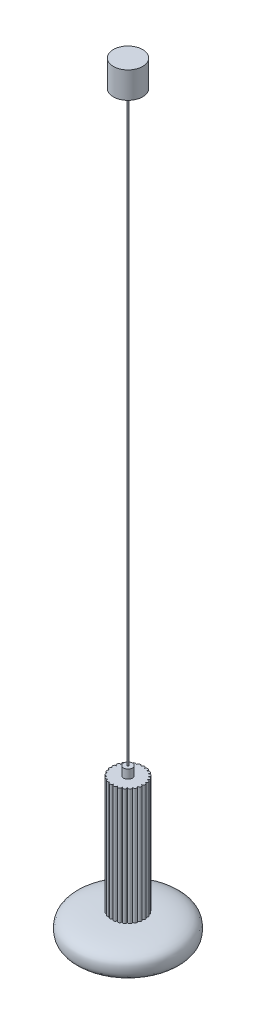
ISO-10303-21;
HEADER;
FILE_DESCRIPTION(('STEP AP214'),'2;1');
FILE_NAME('part.step','',(''),(''),'','','');
FILE_SCHEMA(('AUTOMOTIVE_DESIGN { 1 0 10303 214 1 1 1 1 }'));
ENDSEC;
DATA;
#1=APPLICATION_CONTEXT('core data for automotive mechanical design processes');
#2=APPLICATION_PROTOCOL_DEFINITION('international standard','automotive_design',2000,#1);
#3=PRODUCT_CONTEXT('',#1,'mechanical');
#4=PRODUCT('Part','Part','',(#3));
#5=PRODUCT_RELATED_PRODUCT_CATEGORY('part','',(#4));
#6=PRODUCT_DEFINITION_FORMATION('','',#4);
#7=PRODUCT_DEFINITION_CONTEXT('part definition',#1,'design');
#8=PRODUCT_DEFINITION('design','',#6,#7);
#9=PRODUCT_DEFINITION_SHAPE('','',#8);
#10=(LENGTH_UNIT() NAMED_UNIT(*) SI_UNIT(.MILLI.,.METRE.));
#11=(NAMED_UNIT(*) PLANE_ANGLE_UNIT() SI_UNIT($,.RADIAN.));
#12=(NAMED_UNIT(*) SI_UNIT($,.STERADIAN.) SOLID_ANGLE_UNIT());
#13=UNCERTAINTY_MEASURE_WITH_UNIT(LENGTH_MEASURE(1.E-05),#10,'distance_accuracy_value','');
#14=(GEOMETRIC_REPRESENTATION_CONTEXT(3) GLOBAL_UNCERTAINTY_ASSIGNED_CONTEXT((#13)) GLOBAL_UNIT_ASSIGNED_CONTEXT((#10,
#11,#12)) REPRESENTATION_CONTEXT('',''));
#15=CARTESIAN_POINT('',(0.,0.,0.));
#16=DIRECTION('',(0.,0.,1.));
#17=DIRECTION('',(1.,0.,0.));
#18=AXIS2_PLACEMENT_3D('',#15,#16,#17);
#19=CARTESIAN_POINT('',(0.,1260.,0.));
#20=DIRECTION('',(0.,-1.,0.));
#21=DIRECTION('',(0.,0.,-1.));
#22=AXIS2_PLACEMENT_3D('',#19,#20,#21);
#23=CYLINDRICAL_SURFACE('',#22,25.);
#24=CARTESIAN_POINT('',(0.,1260.,0.));
#25=DIRECTION('',(0.,1.,0.));
#26=DIRECTION('',(0.,0.,1.));
#27=AXIS2_PLACEMENT_3D('',#24,#25,#26);
#28=CIRCLE('',#27,25.);
#29=CARTESIAN_POINT('',(0.,1260.,-25.));
#30=VERTEX_POINT('',#29);
#31=EDGE_CURVE('E11',#30,#30,#28,.T.);
#32=CARTESIAN_POINT('',(0.,1215.,0.));
#33=DIRECTION('',(0.,1.,0.));
#34=DIRECTION('',(0.,0.,1.));
#35=AXIS2_PLACEMENT_3D('',#32,#33,#34);
#36=CIRCLE('',#35,25.);
#37=CARTESIAN_POINT('',(0.,1215.,-25.));
#38=VERTEX_POINT('',#37);
#39=EDGE_CURVE('E46',#38,#38,#36,.T.);
#40=CARTESIAN_POINT('',(0.,1260.,-25.));
#41=CARTESIAN_POINT('',(0.,1259.53125,-25.));
#42=CARTESIAN_POINT('',(0.,1259.0625,-25.));
#43=CARTESIAN_POINT('',(0.,1258.125,-25.));
#44=CARTESIAN_POINT('',(0.,1257.65625,-25.));
#45=CARTESIAN_POINT('',(0.,1256.71875,-25.));
#46=CARTESIAN_POINT('',(0.,1256.25,-25.));
#47=CARTESIAN_POINT('',(0.,1255.3125,-25.));
#48=CARTESIAN_POINT('',(0.,1254.84375,-25.));
#49=CARTESIAN_POINT('',(0.,1253.90625,-25.));
#50=CARTESIAN_POINT('',(0.,1253.4375,-25.));
#51=CARTESIAN_POINT('',(0.,1252.5,-25.));
#52=CARTESIAN_POINT('',(0.,1252.03125,-25.));
#53=CARTESIAN_POINT('',(0.,1251.09375,-25.));
#54=CARTESIAN_POINT('',(0.,1250.625,-25.));
#55=CARTESIAN_POINT('',(0.,1249.6875,-25.));
#56=CARTESIAN_POINT('',(0.,1249.21875,-25.));
#57=CARTESIAN_POINT('',(0.,1248.28125,-25.));
#58=CARTESIAN_POINT('',(0.,1247.8125,-25.));
#59=CARTESIAN_POINT('',(0.,1246.875,-25.));
#60=CARTESIAN_POINT('',(0.,1246.40625,-25.));
#61=CARTESIAN_POINT('',(0.,1245.46875,-25.));
#62=CARTESIAN_POINT('',(0.,1245.,-25.));
#63=CARTESIAN_POINT('',(0.,1244.0625,-25.));
#64=CARTESIAN_POINT('',(0.,1243.59375,-25.));
#65=CARTESIAN_POINT('',(0.,1242.65625,-25.));
#66=CARTESIAN_POINT('',(0.,1242.1875,-25.));
#67=CARTESIAN_POINT('',(0.,1241.25,-25.));
#68=CARTESIAN_POINT('',(0.,1240.78125,-25.));
#69=CARTESIAN_POINT('',(0.,1239.84375,-25.));
#70=CARTESIAN_POINT('',(0.,1239.375,-25.));
#71=CARTESIAN_POINT('',(0.,1238.4375,-25.));
#72=CARTESIAN_POINT('',(0.,1237.96875,-25.));
#73=CARTESIAN_POINT('',(0.,1237.03125,-25.));
#74=CARTESIAN_POINT('',(0.,1236.5625,-25.));
#75=CARTESIAN_POINT('',(0.,1235.625,-25.));
#76=CARTESIAN_POINT('',(0.,1235.15625,-25.));
#77=CARTESIAN_POINT('',(0.,1234.21875,-25.));
#78=CARTESIAN_POINT('',(0.,1233.75,-25.));
#79=CARTESIAN_POINT('',(0.,1232.8125,-25.));
#80=CARTESIAN_POINT('',(0.,1232.34375,-25.));
#81=CARTESIAN_POINT('',(0.,1231.40625,-25.));
#82=CARTESIAN_POINT('',(0.,1230.9375,-25.));
#83=CARTESIAN_POINT('',(0.,1230.,-25.));
#84=CARTESIAN_POINT('',(0.,1229.53125,-25.));
#85=CARTESIAN_POINT('',(0.,1228.59375,-25.));
#86=CARTESIAN_POINT('',(0.,1228.125,-25.));
#87=CARTESIAN_POINT('',(0.,1227.1875,-25.));
#88=CARTESIAN_POINT('',(0.,1226.71875,-25.));
#89=CARTESIAN_POINT('',(0.,1225.78125,-25.));
#90=CARTESIAN_POINT('',(0.,1225.3125,-25.));
#91=CARTESIAN_POINT('',(0.,1224.375,-25.));
#92=CARTESIAN_POINT('',(0.,1223.90625,-25.));
#93=CARTESIAN_POINT('',(0.,1222.96875,-25.));
#94=CARTESIAN_POINT('',(0.,1222.5,-25.));
#95=CARTESIAN_POINT('',(0.,1221.5625,-25.));
#96=CARTESIAN_POINT('',(0.,1221.09375,-25.));
#97=CARTESIAN_POINT('',(0.,1220.15625,-25.));
#98=CARTESIAN_POINT('',(0.,1219.6875,-25.));
#99=CARTESIAN_POINT('',(0.,1218.75,-25.));
#100=CARTESIAN_POINT('',(0.,1218.28125,-25.));
#101=CARTESIAN_POINT('',(0.,1217.34375,-25.));
#102=CARTESIAN_POINT('',(0.,1216.875,-25.));
#103=CARTESIAN_POINT('',(0.,1215.9375,-25.));
#104=CARTESIAN_POINT('',(0.,1215.46875,-25.));
#105=CARTESIAN_POINT('',(0.,1215.,-25.));
#106=B_SPLINE_CURVE_WITH_KNOTS('',3,(#40,#41,#42,#43,#44,#45,#46,#47,#48,#49,#50,#51,#52,#53,
#54,#55,#56,#57,#58,#59,#60,#61,#62,#63,#64,#65,#66,#67,#68,#69,#70,#71,#72,#73,#74,#75,#76,#77,
#78,#79,#80,#81,#82,#83,#84,#85,#86,#87,#88,#89,#90,#91,#92,#93,#94,#95,#96,#97,#98,#99,#100,
#101,#102,#103,#104,#105),.UNSPECIFIED.,.F.,.F.,(4,2,2,2,2,2,2,2,2,2,2,2,2,2,2,2,2,2,2,2,2,2,2,
2,2,2,2,2,2,2,2,2,4),(0.,1.40625000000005,2.81250000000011,4.21875000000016,5.62499999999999,
7.03125000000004,8.4375000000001,9.84375000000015,11.25,12.65625,14.0625000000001,
15.4687500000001,16.875,18.28125,19.6875000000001,21.0937500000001,22.5,23.90625,
25.3125000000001,26.7187500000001,28.125,29.53125,30.9375000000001,32.3437500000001,
33.7499999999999,35.15625,36.5625000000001,37.9687500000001,39.3749999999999,40.78125,42.1875,
43.5937500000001,44.9999999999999),.UNSPECIFIED.);
#107=EDGE_CURVE('BSEAM43',#30,#38,#106,.T.);
#108=ORIENTED_EDGE('',*,*,#31,.F.);
#109=ORIENTED_EDGE('',*,*,#39,.T.);
#110=ORIENTED_EDGE('',*,*,#107,.T.);
#111=ORIENTED_EDGE('',*,*,#107,.F.);
#112=EDGE_LOOP('',(#108,#110,#109,#111));
#113=FACE_BOUND('',#112,.T.);
#114=ADVANCED_FACE('F43',(#113),#23,.T.);
#115=CARTESIAN_POINT('',(0.,1260.,0.));
#116=DIRECTION('',(0.,1.,0.));
#117=DIRECTION('',(0.,0.,1.));
#118=AXIS2_PLACEMENT_3D('',#115,#116,#117);
#119=PLANE('',#118);
#120=ORIENTED_EDGE('',*,*,#31,.T.);
#121=EDGE_LOOP('',(#120));
#122=FACE_BOUND('',#121,.T.);
#123=ADVANCED_FACE('F58',(#122),#119,.T.);
#124=CARTESIAN_POINT('',(0.,1215.,0.));
#125=DIRECTION('',(0.,1.,0.));
#126=DIRECTION('',(0.,0.,1.));
#127=AXIS2_PLACEMENT_3D('',#124,#125,#126);
#128=PLANE('',#127);
#129=ORIENTED_EDGE('',*,*,#39,.F.);
#130=EDGE_LOOP('',(#129));
#131=FACE_BOUND('',#130,.T.);
#132=ADVANCED_FACE('F56',(#131),#128,.F.);
#133=CLOSED_SHELL('',(#114,#123,#132));
#134=MANIFOLD_SOLID_BREP('B2',#133);
#135=CARTESIAN_POINT('',(0.,-31.,0.));
#136=DIRECTION('',(0.,1.,0.));
#137=DIRECTION('',(0.,0.,1.));
#138=AXIS2_PLACEMENT_3D('',#135,#136,#137);
#139=CYLINDRICAL_SURFACE('',#138,25.);
#140=CARTESIAN_POINT('',(0.,-31.,0.));
#141=DIRECTION('',(0.,-1.,0.));
#142=DIRECTION('',(0.,0.,-1.));
#143=AXIS2_PLACEMENT_3D('',#140,#141,#142);
#144=CIRCLE('',#143,25.);
#145=CARTESIAN_POINT('',(0.,-31.,-25.));
#146=VERTEX_POINT('',#145);
#147=EDGE_CURVE('E42',#146,#146,#144,.T.);
#148=ORIENTED_EDGE('',*,*,#147,.F.);
#149=EDGE_LOOP('',(#148));
#150=FACE_BOUND('',#149,.T.);
#151=CARTESIAN_POINT('',(0.,-30.,0.));
#152=DIRECTION('',(0.,-1.,0.));
#153=DIRECTION('',(0.,0.,-1.));
#154=AXIS2_PLACEMENT_3D('',#151,#152,#153);
#155=CIRCLE('',#154,25.);
#156=CARTESIAN_POINT('',(0.,-30.,-25.));
#157=VERTEX_POINT('',#156);
#158=EDGE_CURVE('E94',#157,#157,#155,.T.);
#159=ORIENTED_EDGE('',*,*,#158,.T.);
#160=EDGE_LOOP('',(#159));
#161=FACE_BOUND('',#160,.T.);
#162=ADVANCED_FACE('F91',(#150,#161),#139,.T.);
#163=CARTESIAN_POINT('',(0.,-31.,0.));
#164=DIRECTION('',(0.,-1.,0.));
#165=DIRECTION('',(0.,0.,-1.));
#166=AXIS2_PLACEMENT_3D('',#163,#164,#165);
#167=PLANE('',#166);
#168=ORIENTED_EDGE('',*,*,#147,.T.);
#169=EDGE_LOOP('',(#168));
#170=FACE_BOUND('',#169,.T.);
#171=ADVANCED_FACE('F106',(#170),#167,.T.);
#172=CARTESIAN_POINT('',(0.,-30.,0.));
#173=DIRECTION('',(0.,-1.,0.));
#174=DIRECTION('',(0.,0.,-1.));
#175=AXIS2_PLACEMENT_3D('',#172,#173,#174);
#176=PLANE('',#175);
#177=ORIENTED_EDGE('',*,*,#158,.F.);
#178=EDGE_LOOP('',(#177));
#179=FACE_BOUND('',#178,.T.);
#180=ADVANCED_FACE('F104',(#179),#176,.F.);
#181=CLOSED_SHELL('',(#162,#171,#180));
#182=MANIFOLD_SOLID_BREP('B6',#181);
#183=CARTESIAN_POINT('',(0.,1215.,0.));
#184=DIRECTION('',(0.,-1.,0.));
#185=DIRECTION('',(0.,0.,-1.));
#186=AXIS2_PLACEMENT_3D('',#183,#184,#185);
#187=CYLINDRICAL_SURFACE('',#186,1.5);
#188=CARTESIAN_POINT('',(0.,1215.,0.));
#189=DIRECTION('',(0.,1.,0.));
#190=DIRECTION('',(0.,0.,1.));
#191=AXIS2_PLACEMENT_3D('',#188,#189,#190);
#192=CIRCLE('',#191,1.5);
#193=CARTESIAN_POINT('',(0.,1215.,1.5));
#194=VERTEX_POINT('',#193);
#195=EDGE_CURVE('E90',#194,#194,#192,.T.);
#196=ORIENTED_EDGE('',*,*,#195,.F.);
#197=EDGE_LOOP('',(#196));
#198=FACE_BOUND('',#197,.T.);
#199=CARTESIAN_POINT('',(0.,215.,0.));
#200=DIRECTION('',(0.,1.,0.));
#201=DIRECTION('',(0.,0.,1.));
#202=AXIS2_PLACEMENT_3D('',#199,#200,#201);
#203=CIRCLE('',#202,1.5);
#204=CARTESIAN_POINT('',(0.,215.,1.5));
#205=VERTEX_POINT('',#204);
#206=EDGE_CURVE('E142',#205,#205,#203,.T.);
#207=ORIENTED_EDGE('',*,*,#206,.T.);
#208=EDGE_LOOP('',(#207));
#209=FACE_BOUND('',#208,.T.);
#210=ADVANCED_FACE('F139',(#198,#209),#187,.T.);
#211=CARTESIAN_POINT('',(0.,1215.,0.));
#212=DIRECTION('',(0.,1.,0.));
#213=DIRECTION('',(0.,0.,1.));
#214=AXIS2_PLACEMENT_3D('',#211,#212,#213);
#215=PLANE('',#214);
#216=ORIENTED_EDGE('',*,*,#195,.T.);
#217=EDGE_LOOP('',(#216));
#218=FACE_BOUND('',#217,.T.);
#219=ADVANCED_FACE('F154',(#218),#215,.T.);
#220=CARTESIAN_POINT('',(0.,215.,0.));
#221=DIRECTION('',(0.,1.,0.));
#222=DIRECTION('',(0.,0.,1.));
#223=AXIS2_PLACEMENT_3D('',#220,#221,#222);
#224=PLANE('',#223);
#225=ORIENTED_EDGE('',*,*,#206,.F.);
#226=EDGE_LOOP('',(#225));
#227=FACE_BOUND('',#226,.T.);
#228=ADVANCED_FACE('F152',(#227),#224,.F.);
#229=CLOSED_SHELL('',(#210,#219,#228));
#230=MANIFOLD_SOLID_BREP('B37',#229);
#231=CARTESIAN_POINT('',(0.,215.,0.));
#232=DIRECTION('',(0.,-1.,0.));
#233=DIRECTION('',(0.,0.,-1.));
#234=AXIS2_PLACEMENT_3D('',#231,#232,#233);
#235=CYLINDRICAL_SURFACE('',#234,7.5);
#236=CARTESIAN_POINT('',(0.,215.,0.));
#237=DIRECTION('',(0.,1.,0.));
#238=DIRECTION('',(0.,0.,1.));
#239=AXIS2_PLACEMENT_3D('',#236,#237,#238);
#240=CIRCLE('',#239,7.5);
#241=CARTESIAN_POINT('',(0.,215.,7.5));
#242=VERTEX_POINT('',#241);
#243=EDGE_CURVE('E138',#242,#242,#240,.T.);
#244=ORIENTED_EDGE('',*,*,#243,.F.);
#245=EDGE_LOOP('',(#244));
#246=FACE_BOUND('',#245,.T.);
#247=CARTESIAN_POINT('',(0.,200.,0.));
#248=DIRECTION('',(0.,1.,0.));
#249=DIRECTION('',(0.,0.,1.));
#250=AXIS2_PLACEMENT_3D('',#247,#248,#249);
#251=CIRCLE('',#250,7.5);
#252=CARTESIAN_POINT('',(0.,200.,7.5));
#253=VERTEX_POINT('',#252);
#254=EDGE_CURVE('E193',#253,#253,#251,.T.);
#255=ORIENTED_EDGE('',*,*,#254,.T.);
#256=EDGE_LOOP('',(#255));
#257=FACE_BOUND('',#256,.T.);
#258=ADVANCED_FACE('F190',(#246,#257),#235,.T.);
#259=CARTESIAN_POINT('',(0.,215.,0.));
#260=DIRECTION('',(0.,1.,0.));
#261=DIRECTION('',(0.,0.,1.));
#262=AXIS2_PLACEMENT_3D('',#259,#260,#261);
#263=PLANE('',#262);
#264=ORIENTED_EDGE('',*,*,#243,.T.);
#265=EDGE_LOOP('',(#264));
#266=FACE_BOUND('',#265,.T.);
#267=ADVANCED_FACE('F205',(#266),#263,.T.);
#268=CARTESIAN_POINT('',(0.,200.,0.));
#269=DIRECTION('',(0.,1.,0.));
#270=DIRECTION('',(0.,0.,1.));
#271=AXIS2_PLACEMENT_3D('',#268,#269,#270);
#272=PLANE('',#271);
#273=ORIENTED_EDGE('',*,*,#254,.F.);
#274=EDGE_LOOP('',(#273));
#275=FACE_BOUND('',#274,.T.);
#276=ADVANCED_FACE('F203',(#275),#272,.F.);
#277=CLOSED_SHELL('',(#258,#267,#276));
#278=MANIFOLD_SOLID_BREP('B85',#277);
#279=CARTESIAN_POINT('',(0.,200.,0.));
#280=DIRECTION('',(0.,-1.,0.));
#281=DIRECTION('',(0.,0.,-1.));
#282=AXIS2_PLACEMENT_3D('',#279,#280,#281);
#283=CYLINDRICAL_SURFACE('',#282,25.);
#284=CARTESIAN_POINT('',(0.,1.,0.));
#285=DIRECTION('',(0.,1.,0.));
#286=DIRECTION('',(0.,0.,1.));
#287=AXIS2_PLACEMENT_3D('',#284,#285,#286);
#288=CIRCLE('',#287,25.);
#289=CARTESIAN_POINT('',(-3.27196858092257,1.,-24.7849595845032));
#290=VERTEX_POINT('',#289);
#291=CARTESIAN_POINT('',(-9.07299741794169,1.,-23.2955085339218));
#292=VERTEX_POINT('',#291);
#293=EDGE_CURVE('E188',#290,#292,#288,.T.);
#294=ORIENTED_EDGE('',*,*,#293,.F.);
#295=DIRECTION('',(0.,1.,0.));
#296=VECTOR('',#295,1.);
#297=CARTESIAN_POINT('',(-3.27196858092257,100.5,-24.7849595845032));
#298=LINE('',#297,#296);
#299=CARTESIAN_POINT('',(-3.27196858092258,200.,-24.7849595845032));
#300=VERTEX_POINT('',#299);
#301=EDGE_CURVE('E550',#290,#300,#298,.T.);
#302=ORIENTED_EDGE('',*,*,#301,.T.);
#303=CARTESIAN_POINT('',(0.,200.,0.));
#304=DIRECTION('',(0.,1.,0.));
#305=DIRECTION('',(0.,0.,1.));
#306=AXIS2_PLACEMENT_3D('',#303,#304,#305);
#307=CIRCLE('',#306,25.);
#308=CARTESIAN_POINT('',(-2.99459513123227,200.,-24.82));
#309=VERTEX_POINT('',#308);
#310=EDGE_CURVE('E858',#309,#300,#307,.T.);
#311=ORIENTED_EDGE('',*,*,#310,.F.);
#312=DIRECTION('',(0.,1.,0.));
#313=VECTOR('',#312,1.);
#314=CARTESIAN_POINT('',(-2.99459513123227,100.5,-24.82));
#315=LINE('',#314,#313);
#316=CARTESIAN_POINT('',(-2.99459513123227,1.,-24.82));
#317=VERTEX_POINT('',#316);
#318=EDGE_CURVE('E875',#309,#317,#315,.F.);
#319=ORIENTED_EDGE('',*,*,#318,.T.);
#320=CARTESIAN_POINT('',(0.,1.,0.));
#321=DIRECTION('',(0.,1.,0.));
#322=DIRECTION('',(0.,0.,1.));
#323=AXIS2_PLACEMENT_3D('',#320,#321,#322);
#324=CIRCLE('',#323,25.);
#325=CARTESIAN_POINT('',(2.99459513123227,1.,-24.82));
#326=VERTEX_POINT('',#325);
#327=EDGE_CURVE('E863',#326,#317,#324,.T.);
#328=ORIENTED_EDGE('',*,*,#327,.F.);
#329=DIRECTION('',(0.,1.,0.));
#330=VECTOR('',#329,1.);
#331=CARTESIAN_POINT('',(2.99459513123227,100.5,-24.82));
#332=LINE('',#331,#330);
#333=CARTESIAN_POINT('',(2.99459513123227,200.,-24.82));
#334=VERTEX_POINT('',#333);
#335=EDGE_CURVE('E871',#326,#334,#332,.T.);
#336=ORIENTED_EDGE('',*,*,#335,.T.);
#337=CARTESIAN_POINT('',(3.27196858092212,200.,-24.7849595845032));
#338=VERTEX_POINT('',#337);
#339=EDGE_CURVE('E865',#338,#334,#307,.T.);
#340=ORIENTED_EDGE('',*,*,#339,.F.);
#341=DIRECTION('',(0.,1.,0.));
#342=VECTOR('',#341,1.);
#343=CARTESIAN_POINT('',(3.2719685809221,100.5,-24.7849595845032));
#344=LINE('',#343,#342);
#345=CARTESIAN_POINT('',(3.2719685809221,1.,-24.7849595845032));
#346=VERTEX_POINT('',#345);
#347=EDGE_CURVE('E814',#338,#346,#344,.F.);
#348=ORIENTED_EDGE('',*,*,#347,.T.);
#349=CARTESIAN_POINT('',(0.,1.,0.));
#350=DIRECTION('',(0.,1.,0.));
#351=DIRECTION('',(0.,0.,1.));
#352=AXIS2_PLACEMENT_3D('',#349,#350,#351);
#353=CIRCLE('',#352,25.);
#354=CARTESIAN_POINT('',(9.07299741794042,1.,-23.2955085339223));
#355=VERTEX_POINT('',#354);
#356=EDGE_CURVE('E1524',#355,#346,#353,.T.);
#357=ORIENTED_EDGE('',*,*,#356,.F.);
#358=DIRECTION('',(0.,1.,0.));
#359=VECTOR('',#358,1.);
#360=CARTESIAN_POINT('',(9.07299741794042,100.5,-23.2955085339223));
#361=LINE('',#360,#359);
#362=CARTESIAN_POINT('',(9.07299741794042,200.,-23.2955085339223));
#363=VERTEX_POINT('',#362);
#364=EDGE_CURVE('E818',#355,#363,#361,.T.);
#365=ORIENTED_EDGE('',*,*,#364,.T.);
#366=CARTESIAN_POINT('',(9.3329424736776,200.,-23.1925890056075));
#367=VERTEX_POINT('',#366);
#368=EDGE_CURVE('E870',#367,#363,#307,.T.);
#369=ORIENTED_EDGE('',*,*,#368,.F.);
#370=DIRECTION('',(0.,1.,0.));
#371=VECTOR('',#370,1.);
#372=CARTESIAN_POINT('',(9.3329424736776,100.5,-23.1925890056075));
#373=LINE('',#372,#371);
#374=CARTESIAN_POINT('',(9.3329424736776,1.,-23.1925890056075));
#375=VERTEX_POINT('',#374);
#376=EDGE_CURVE('E803',#367,#375,#373,.F.);
#377=ORIENTED_EDGE('',*,*,#376,.T.);
#378=CARTESIAN_POINT('',(0.,1.,0.));
#379=DIRECTION('',(0.,1.,0.));
#380=DIRECTION('',(0.,0.,1.));
#381=AXIS2_PLACEMENT_3D('',#378,#379,#380);
#382=CIRCLE('',#381,25.);
#383=CARTESIAN_POINT('',(14.5813099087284,1.,-20.3072745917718));
#384=VERTEX_POINT('',#383);
#385=EDGE_CURVE('E1522',#384,#375,#382,.T.);
#386=ORIENTED_EDGE('',*,*,#385,.F.);
#387=DIRECTION('',(0.,1.,0.));
#388=VECTOR('',#387,1.);
#389=CARTESIAN_POINT('',(14.5813099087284,100.5,-20.3072745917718));
#390=LINE('',#389,#388);
#391=CARTESIAN_POINT('',(14.5813099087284,200.,-20.3072745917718));
#392=VERTEX_POINT('',#391);
#393=EDGE_CURVE('E807',#384,#392,#390,.T.);
#394=ORIENTED_EDGE('',*,*,#393,.T.);
#395=CARTESIAN_POINT('',(14.80749326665,200.,-20.1429427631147));
#396=VERTEX_POINT('',#395);
#397=EDGE_CURVE('E873',#396,#392,#307,.T.);
#398=ORIENTED_EDGE('',*,*,#397,.F.);
#399=DIRECTION('',(0.,1.,0.));
#400=VECTOR('',#399,1.);
#401=CARTESIAN_POINT('',(14.8074932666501,100.5,-20.1429427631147));
#402=LINE('',#401,#400);
#403=CARTESIAN_POINT('',(14.8074932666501,1.,-20.1429427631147));
#404=VERTEX_POINT('',#403);
#405=EDGE_CURVE('E792',#396,#404,#402,.F.);
#406=ORIENTED_EDGE('',*,*,#405,.T.);
#407=CARTESIAN_POINT('',(0.,1.,0.));
#408=DIRECTION('',(0.,1.,0.));
#409=DIRECTION('',(0.,0.,1.));
#410=AXIS2_PLACEMENT_3D('',#407,#408,#409);
#411=CIRCLE('',#410,25.);
#412=CARTESIAN_POINT('',(19.1734250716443,1.,-16.0430599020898));
#413=VERTEX_POINT('',#412);
#414=EDGE_CURVE('E1520',#413,#404,#411,.T.);
#415=ORIENTED_EDGE('',*,*,#414,.F.);
#416=DIRECTION('',(0.,1.,0.));
#417=VECTOR('',#416,1.);
#418=CARTESIAN_POINT('',(19.1734250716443,100.5,-16.0430599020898));
#419=LINE('',#418,#417);
#420=CARTESIAN_POINT('',(19.1734250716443,200.,-16.0430599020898));
#421=VERTEX_POINT('',#420);
#422=EDGE_CURVE('E796',#413,#421,#419,.T.);
#423=ORIENTED_EDGE('',*,*,#422,.T.);
#424=CARTESIAN_POINT('',(19.3516347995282,200.,-15.8276413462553));
#425=VERTEX_POINT('',#424);
#426=EDGE_CURVE('E1540',#425,#421,#307,.T.);
#427=ORIENTED_EDGE('',*,*,#426,.F.);
#428=DIRECTION('',(0.,1.,0.));
#429=VECTOR('',#428,1.);
#430=CARTESIAN_POINT('',(19.3516347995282,100.5,-15.8276413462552));
#431=LINE('',#430,#429);
#432=CARTESIAN_POINT('',(19.3516347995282,1.,-15.8276413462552));
#433=VERTEX_POINT('',#432);
#434=EDGE_CURVE('E781',#425,#433,#431,.F.);
#435=ORIENTED_EDGE('',*,*,#434,.T.);
#436=CARTESIAN_POINT('',(0.,1.,0.));
#437=DIRECTION('',(0.,1.,0.));
#438=DIRECTION('',(0.,0.,1.));
#439=AXIS2_PLACEMENT_3D('',#436,#437,#438);
#440=CIRCLE('',#439,25.);
#441=CARTESIAN_POINT('',(22.5608034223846,1.,-10.7708007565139));
#442=VERTEX_POINT('',#441);
#443=EDGE_CURVE('E1518',#442,#433,#440,.T.);
#444=ORIENTED_EDGE('',*,*,#443,.F.);
#445=DIRECTION('',(0.,1.,0.));
#446=VECTOR('',#445,1.);
#447=CARTESIAN_POINT('',(22.5608034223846,100.5,-10.7708007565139));
#448=LINE('',#447,#446);
#449=CARTESIAN_POINT('',(22.5608034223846,200.,-10.7708007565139));
#450=VERTEX_POINT('',#449);
#451=EDGE_CURVE('E785',#442,#450,#448,.T.);
#452=ORIENTED_EDGE('',*,*,#451,.T.);
#453=CARTESIAN_POINT('',(22.6798419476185,200.,-10.517831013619));
#454=VERTEX_POINT('',#453);
#455=EDGE_CURVE('E1541',#454,#450,#307,.T.);
#456=ORIENTED_EDGE('',*,*,#455,.F.);
#457=DIRECTION('',(0.,1.,0.));
#458=VECTOR('',#457,1.);
#459=CARTESIAN_POINT('',(22.6798419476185,100.5,-10.517831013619));
#460=LINE('',#459,#458);
#461=CARTESIAN_POINT('',(22.6798419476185,1.,-10.517831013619));
#462=VERTEX_POINT('',#461);
#463=EDGE_CURVE('E770',#454,#462,#460,.F.);
#464=ORIENTED_EDGE('',*,*,#463,.T.);
#465=CARTESIAN_POINT('',(0.,1.,0.));
#466=DIRECTION('',(0.,1.,0.));
#467=DIRECTION('',(0.,0.,1.));
#468=AXIS2_PLACEMENT_3D('',#465,#466,#467);
#469=CIRCLE('',#468,25.);
#470=CARTESIAN_POINT('',(24.5306035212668,1.,-4.82177258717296));
#471=VERTEX_POINT('',#470);
#472=EDGE_CURVE('E1516',#471,#462,#469,.T.);
#473=ORIENTED_EDGE('',*,*,#472,.F.);
#474=DIRECTION('',(0.,1.,0.));
#475=VECTOR('',#474,1.);
#476=CARTESIAN_POINT('',(24.5306035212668,100.5,-4.82177258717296));
#477=LINE('',#476,#475);
#478=CARTESIAN_POINT('',(24.5306035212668,200.,-4.82177258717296));
#479=VERTEX_POINT('',#478);
#480=EDGE_CURVE('E774',#471,#479,#477,.T.);
#481=ORIENTED_EDGE('',*,*,#480,.T.);
#482=CARTESIAN_POINT('',(24.5829912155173,200.,-4.5471466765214));
#483=VERTEX_POINT('',#482);
#484=EDGE_CURVE('E1544',#483,#479,#307,.T.);
#485=ORIENTED_EDGE('',*,*,#484,.F.);
#486=DIRECTION('',(0.,1.,0.));
#487=VECTOR('',#486,1.);
#488=CARTESIAN_POINT('',(24.5829912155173,100.5,-4.54714667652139));
#489=LINE('',#488,#487);
#490=CARTESIAN_POINT('',(24.5829912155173,1.,-4.54714667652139));
#491=VERTEX_POINT('',#490);
#492=EDGE_CURVE('E759',#483,#491,#489,.F.);
#493=ORIENTED_EDGE('',*,*,#492,.T.);
#494=CARTESIAN_POINT('',(0.,1.,0.));
#495=DIRECTION('',(0.,1.,0.));
#496=DIRECTION('',(0.,0.,1.));
#497=AXIS2_PLACEMENT_3D('',#494,#495,#496);
#498=CIRCLE('',#497,25.);
#499=CARTESIAN_POINT('',(24.9590555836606,1.,1.43022528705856));
#500=VERTEX_POINT('',#499);
#501=EDGE_CURVE('E1514',#500,#491,#498,.T.);
#502=ORIENTED_EDGE('',*,*,#501,.F.);
#503=DIRECTION('',(0.,1.,0.));
#504=VECTOR('',#503,1.);
#505=CARTESIAN_POINT('',(24.9590555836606,100.5,1.43022528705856));
#506=LINE('',#505,#504);
#507=CARTESIAN_POINT('',(24.9590555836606,200.,1.43022528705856));
#508=VERTEX_POINT('',#507);
#509=EDGE_CURVE('E763',#500,#508,#506,.T.);
#510=ORIENTED_EDGE('',*,*,#509,.T.);
#511=CARTESIAN_POINT('',(24.9415007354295,200.,1.70925160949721));
#512=VERTEX_POINT('',#511);
#513=EDGE_CURVE('E1547',#512,#508,#307,.T.);
#514=ORIENTED_EDGE('',*,*,#513,.F.);
#515=DIRECTION('',(0.,1.,0.));
#516=VECTOR('',#515,1.);
#517=CARTESIAN_POINT('',(24.9415007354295,100.5,1.70925160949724));
#518=LINE('',#517,#516);
#519=CARTESIAN_POINT('',(24.9415007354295,1.,1.70925160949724));
#520=VERTEX_POINT('',#519);
#521=EDGE_CURVE('E748',#512,#520,#518,.F.);
#522=ORIENTED_EDGE('',*,*,#521,.T.);
#523=CARTESIAN_POINT('',(0.,1.,0.));
#524=DIRECTION('',(0.,1.,0.));
#525=DIRECTION('',(0.,0.,1.));
#526=AXIS2_PLACEMENT_3D('',#523,#524,#525);
#527=CIRCLE('',#526,25.);
#528=CARTESIAN_POINT('',(23.8192383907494,1.,7.59235684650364));
#529=VERTEX_POINT('',#528);
#530=EDGE_CURVE('E1512',#529,#520,#527,.T.);
#531=ORIENTED_EDGE('',*,*,#530,.F.);
#532=DIRECTION('',(0.,1.,0.));
#533=VECTOR('',#532,1.);
#534=CARTESIAN_POINT('',(23.8192383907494,100.5,7.59235684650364));
#535=LINE('',#534,#533);
#536=CARTESIAN_POINT('',(23.8192383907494,200.,7.59235684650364));
#537=VERTEX_POINT('',#536);
#538=EDGE_CURVE('E752',#529,#537,#535,.T.);
#539=ORIENTED_EDGE('',*,*,#538,.T.);
#540=CARTESIAN_POINT('',(23.7328440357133,200.,7.85825133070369));
#541=VERTEX_POINT('',#540);
#542=EDGE_CURVE('E1550',#541,#537,#307,.T.);
#543=ORIENTED_EDGE('',*,*,#542,.F.);
#544=DIRECTION('',(0.,1.,0.));
#545=VECTOR('',#544,1.);
#546=CARTESIAN_POINT('',(23.7328440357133,100.5,7.8582513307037));
#547=LINE('',#546,#545);
#548=CARTESIAN_POINT('',(23.7328440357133,1.,7.8582513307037));
#549=VERTEX_POINT('',#548);
#550=EDGE_CURVE('E737',#541,#549,#547,.F.);
#551=ORIENTED_EDGE('',*,*,#550,.T.);
#552=CARTESIAN_POINT('',(0.,1.,0.));
#553=DIRECTION('',(0.,1.,0.));
#554=DIRECTION('',(0.,0.,1.));
#555=AXIS2_PLACEMENT_3D('',#552,#553,#554);
#556=CIRCLE('',#555,25.);
#557=CARTESIAN_POINT('',(21.182770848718,1.,13.2774327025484));
#558=VERTEX_POINT('',#557);
#559=EDGE_CURVE('E1510',#558,#549,#556,.T.);
#560=ORIENTED_EDGE('',*,*,#559,.F.);
#561=DIRECTION('',(0.,1.,0.));
#562=VECTOR('',#561,1.);
#563=CARTESIAN_POINT('',(21.182770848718,100.5,13.2774327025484));
#564=LINE('',#563,#562);
#565=CARTESIAN_POINT('',(21.182770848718,200.,13.2774327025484));
#566=VERTEX_POINT('',#565);
#567=EDGE_CURVE('E741',#558,#566,#564,.T.);
#568=ORIENTED_EDGE('',*,*,#567,.T.);
#569=CARTESIAN_POINT('',(21.03296546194,200.,13.5134882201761));
#570=VERTEX_POINT('',#569);
#571=EDGE_CURVE('E1553',#570,#566,#307,.T.);
#572=ORIENTED_EDGE('',*,*,#571,.F.);
#573=DIRECTION('',(0.,1.,0.));
#574=VECTOR('',#573,1.);
#575=CARTESIAN_POINT('',(21.03296546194,100.5,13.5134882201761));
#576=LINE('',#575,#574);
#577=CARTESIAN_POINT('',(21.03296546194,1.,13.5134882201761));
#578=VERTEX_POINT('',#577);
#579=EDGE_CURVE('E726',#570,#578,#576,.F.);
#580=ORIENTED_EDGE('',*,*,#579,.T.);
#581=CARTESIAN_POINT('',(0.,1.,0.));
#582=DIRECTION('',(0.,1.,0.));
#583=DIRECTION('',(0.,0.,1.));
#584=AXIS2_PLACEMENT_3D('',#581,#582,#583);
#585=CIRCLE('',#584,25.);
#586=CARTESIAN_POINT('',(17.2153119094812,1.,18.1282386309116));
#587=VERTEX_POINT('',#586);
#588=EDGE_CURVE('E1508',#587,#578,#585,.T.);
#589=ORIENTED_EDGE('',*,*,#588,.F.);
#590=DIRECTION('',(0.,1.,0.));
#591=VECTOR('',#590,1.);
#592=CARTESIAN_POINT('',(17.2153119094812,100.5,18.1282386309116));
#593=LINE('',#592,#591);
#594=CARTESIAN_POINT('',(17.2153119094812,200.,18.1282386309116));
#595=VERTEX_POINT('',#594);
#596=EDGE_CURVE('E730',#587,#595,#593,.T.);
#597=ORIENTED_EDGE('',*,*,#596,.T.);
#598=CARTESIAN_POINT('',(17.011508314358,200.,18.319622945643));
#599=VERTEX_POINT('',#598);
#600=EDGE_CURVE('E1556',#599,#595,#307,.T.);
#601=ORIENTED_EDGE('',*,*,#600,.F.);
#602=DIRECTION('',(0.,1.,0.));
#603=VECTOR('',#602,1.);
#604=CARTESIAN_POINT('',(17.011508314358,100.5,18.319622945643));
#605=LINE('',#604,#603);
#606=CARTESIAN_POINT('',(17.011508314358,1.,18.319622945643));
#607=VERTEX_POINT('',#606);
#608=EDGE_CURVE('E715',#599,#607,#605,.F.);
#609=ORIENTED_EDGE('',*,*,#608,.T.);
#610=CARTESIAN_POINT('',(0.,1.,0.));
#611=DIRECTION('',(0.,1.,0.));
#612=DIRECTION('',(0.,0.,1.));
#613=AXIS2_PLACEMENT_3D('',#610,#611,#612);
#614=CIRCLE('',#613,25.);
#615=CARTESIAN_POINT('',(12.1661516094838,1.,21.839980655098));
#616=VERTEX_POINT('',#615);
#617=EDGE_CURVE('E1506',#616,#607,#614,.T.);
#618=ORIENTED_EDGE('',*,*,#617,.F.);
#619=DIRECTION('',(0.,1.,0.));
#620=VECTOR('',#619,1.);
#621=CARTESIAN_POINT('',(12.1661516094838,100.5,21.839980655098));
#622=LINE('',#621,#620);
#623=CARTESIAN_POINT('',(12.1661516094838,200.,21.839980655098));
#624=VERTEX_POINT('',#623);
#625=EDGE_CURVE('E719',#616,#624,#622,.T.);
#626=ORIENTED_EDGE('',*,*,#625,.T.);
#627=CARTESIAN_POINT('',(11.9211555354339,200.,21.9746683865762));
#628=VERTEX_POINT('',#627);
#629=EDGE_CURVE('E1559',#628,#624,#307,.T.);
#630=ORIENTED_EDGE('',*,*,#629,.F.);
#631=DIRECTION('',(0.,1.,0.));
#632=VECTOR('',#631,1.);
#633=CARTESIAN_POINT('',(11.9211555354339,100.5,21.9746683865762));
#634=LINE('',#633,#632);
#635=CARTESIAN_POINT('',(11.9211555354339,1.,21.9746683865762));
#636=VERTEX_POINT('',#635);
#637=EDGE_CURVE('E704',#628,#636,#634,.F.);
#638=ORIENTED_EDGE('',*,*,#637,.T.);
#639=CARTESIAN_POINT('',(0.,1.,0.));
#640=DIRECTION('',(0.,1.,0.));
#641=DIRECTION('',(0.,0.,1.));
#642=AXIS2_PLACEMENT_3D('',#639,#640,#641);
#643=CIRCLE('',#642,25.);
#644=CARTESIAN_POINT('',(6.35254725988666,1.,24.1794363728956));
#645=VERTEX_POINT('',#644);
#646=EDGE_CURVE('E1504',#645,#636,#643,.T.);
#647=ORIENTED_EDGE('',*,*,#646,.F.);
#648=DIRECTION('',(0.,1.,0.));
#649=VECTOR('',#648,1.);
#650=CARTESIAN_POINT('',(6.35254725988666,100.5,24.1794363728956));
#651=LINE('',#650,#649);
#652=CARTESIAN_POINT('',(6.35254725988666,200.,24.1794363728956));
#653=VERTEX_POINT('',#652);
#654=EDGE_CURVE('E708',#645,#653,#651,.T.);
#655=ORIENTED_EDGE('',*,*,#654,.T.);
#656=CARTESIAN_POINT('',(6.08175271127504,200.,24.2489645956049));
#657=VERTEX_POINT('',#656);
#658=EDGE_CURVE('E1562',#657,#653,#307,.T.);
#659=ORIENTED_EDGE('',*,*,#658,.F.);
#660=DIRECTION('',(0.,1.,0.));
#661=VECTOR('',#660,1.);
#662=CARTESIAN_POINT('',(6.08175271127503,100.5,24.2489645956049));
#663=LINE('',#662,#661);
#664=CARTESIAN_POINT('',(6.08175271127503,1.,24.2489645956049));
#665=VERTEX_POINT('',#664);
#666=EDGE_CURVE('E693',#657,#665,#663,.F.);
#667=ORIENTED_EDGE('',*,*,#666,.T.);
#668=CARTESIAN_POINT('',(0.,1.,0.));
#669=DIRECTION('',(0.,1.,0.));
#670=DIRECTION('',(0.,0.,1.));
#671=AXIS2_PLACEMENT_3D('',#668,#669,#670);
#672=CIRCLE('',#671,25.);
#673=CARTESIAN_POINT('',(0.139789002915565,1.,24.9996091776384));
#674=VERTEX_POINT('',#673);
#675=EDGE_CURVE('E1502',#674,#665,#672,.T.);
#676=ORIENTED_EDGE('',*,*,#675,.F.);
#677=DIRECTION('',(0.,1.,0.));
#678=VECTOR('',#677,1.);
#679=CARTESIAN_POINT('',(0.139789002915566,100.5,24.9996091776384));
#680=LINE('',#679,#678);
#681=CARTESIAN_POINT('',(0.139789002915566,200.,24.9996091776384));
#682=VERTEX_POINT('',#681);
#683=EDGE_CURVE('E697',#674,#682,#680,.T.);
#684=ORIENTED_EDGE('',*,*,#683,.T.);
#685=CARTESIAN_POINT('',(-0.139789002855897,200.,24.9996091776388));
#686=VERTEX_POINT('',#685);
#687=EDGE_CURVE('E1565',#686,#682,#307,.T.);
#688=ORIENTED_EDGE('',*,*,#687,.F.);
#689=DIRECTION('',(0.,1.,0.));
#690=VECTOR('',#689,1.);
#691=CARTESIAN_POINT('',(-0.139789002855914,100.5,24.9996091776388));
#692=LINE('',#691,#690);
#693=CARTESIAN_POINT('',(-0.139789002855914,1.,24.9996091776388));
#694=VERTEX_POINT('',#693);
#695=EDGE_CURVE('E682',#686,#694,#692,.F.);
#696=ORIENTED_EDGE('',*,*,#695,.T.);
#697=CARTESIAN_POINT('',(0.,1.,0.));
#698=DIRECTION('',(0.,1.,0.));
#699=DIRECTION('',(0.,0.,1.));
#700=AXIS2_PLACEMENT_3D('',#697,#698,#699);
#701=CIRCLE('',#700,25.);
#702=CARTESIAN_POINT('',(-6.08175271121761,1.,24.2489645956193));
#703=VERTEX_POINT('',#702);
#704=EDGE_CURVE('E1500',#703,#694,#701,.T.);
#705=ORIENTED_EDGE('',*,*,#704,.F.);
#706=DIRECTION('',(0.,1.,0.));
#707=VECTOR('',#706,1.);
#708=CARTESIAN_POINT('',(-6.08175271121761,100.5,24.2489645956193));
#709=LINE('',#708,#707);
#710=CARTESIAN_POINT('',(-6.08175271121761,200.,24.2489645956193));
#711=VERTEX_POINT('',#710);
#712=EDGE_CURVE('E686',#703,#711,#709,.T.);
#713=ORIENTED_EDGE('',*,*,#712,.T.);
#714=CARTESIAN_POINT('',(-6.35254725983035,200.,24.1794363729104));
#715=VERTEX_POINT('',#714);
#716=EDGE_CURVE('E1568',#715,#711,#307,.T.);
#717=ORIENTED_EDGE('',*,*,#716,.F.);
#718=DIRECTION('',(0.,1.,0.));
#719=VECTOR('',#718,1.);
#720=CARTESIAN_POINT('',(-6.35254725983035,100.5,24.1794363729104));
#721=LINE('',#720,#719);
#722=CARTESIAN_POINT('',(-6.35254725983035,1.,24.1794363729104));
#723=VERTEX_POINT('',#722);
#724=EDGE_CURVE('E671',#715,#723,#721,.F.);
#725=ORIENTED_EDGE('',*,*,#724,.T.);
#726=CARTESIAN_POINT('',(0.,1.,0.));
#727=DIRECTION('',(0.,1.,0.));
#728=DIRECTION('',(0.,0.,1.));
#729=AXIS2_PLACEMENT_3D('',#726,#727,#728);
#730=CIRCLE('',#729,25.);
#731=CARTESIAN_POINT('',(-11.9211555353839,1.,21.9746683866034));
#732=VERTEX_POINT('',#731);
#733=EDGE_CURVE('E1498',#732,#723,#730,.T.);
#734=ORIENTED_EDGE('',*,*,#733,.F.);
#735=DIRECTION('',(0.,1.,0.));
#736=VECTOR('',#735,1.);
#737=CARTESIAN_POINT('',(-11.9211555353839,100.5,21.9746683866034));
#738=LINE('',#737,#736);
#739=CARTESIAN_POINT('',(-11.9211555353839,200.,21.9746683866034));
#740=VERTEX_POINT('',#739);
#741=EDGE_CURVE('E675',#732,#740,#738,.T.);
#742=ORIENTED_EDGE('',*,*,#741,.T.);
#743=CARTESIAN_POINT('',(-12.1661516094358,200.,21.8399806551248));
#744=VERTEX_POINT('',#743);
#745=EDGE_CURVE('E1571',#744,#740,#307,.T.);
#746=ORIENTED_EDGE('',*,*,#745,.F.);
#747=DIRECTION('',(0.,1.,0.));
#748=VECTOR('',#747,1.);
#749=CARTESIAN_POINT('',(-12.1661516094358,100.5,21.8399806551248));
#750=LINE('',#749,#748);
#751=CARTESIAN_POINT('',(-12.1661516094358,1.,21.8399806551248));
#752=VERTEX_POINT('',#751);
#753=EDGE_CURVE('E660',#744,#752,#750,.F.);
#754=ORIENTED_EDGE('',*,*,#753,.T.);
#755=CARTESIAN_POINT('',(0.,1.,0.));
#756=DIRECTION('',(0.,1.,0.));
#757=DIRECTION('',(0.,0.,1.));
#758=AXIS2_PLACEMENT_3D('',#755,#756,#757);
#759=CIRCLE('',#758,25.);
#760=CARTESIAN_POINT('',(-17.0115083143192,1.,18.319622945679));
#761=VERTEX_POINT('',#760);
#762=EDGE_CURVE('E1496',#761,#752,#759,.T.);
#763=ORIENTED_EDGE('',*,*,#762,.F.);
#764=DIRECTION('',(0.,1.,0.));
#765=VECTOR('',#764,1.);
#766=CARTESIAN_POINT('',(-17.0115083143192,100.5,18.319622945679));
#767=LINE('',#766,#765);
#768=CARTESIAN_POINT('',(-17.0115083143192,200.,18.319622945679));
#769=VERTEX_POINT('',#768);
#770=EDGE_CURVE('E664',#761,#769,#767,.T.);
#771=ORIENTED_EDGE('',*,*,#770,.T.);
#772=CARTESIAN_POINT('',(-17.2153119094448,200.,18.1282386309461));
#773=VERTEX_POINT('',#772);
#774=EDGE_CURVE('E1574',#773,#769,#307,.T.);
#775=ORIENTED_EDGE('',*,*,#774,.F.);
#776=DIRECTION('',(0.,1.,0.));
#777=VECTOR('',#776,1.);
#778=CARTESIAN_POINT('',(-17.2153119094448,100.5,18.1282386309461));
#779=LINE('',#778,#777);
#780=CARTESIAN_POINT('',(-17.2153119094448,1.,18.1282386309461));
#781=VERTEX_POINT('',#780);
#782=EDGE_CURVE('E649',#773,#781,#779,.F.);
#783=ORIENTED_EDGE('',*,*,#782,.T.);
#784=CARTESIAN_POINT('',(0.,1.,0.));
#785=DIRECTION('',(0.,1.,0.));
#786=DIRECTION('',(0.,0.,1.));
#787=AXIS2_PLACEMENT_3D('',#784,#785,#786);
#788=CIRCLE('',#787,25.);
#789=CARTESIAN_POINT('',(-21.0329654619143,1.,13.5134882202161));
#790=VERTEX_POINT('',#789);
#791=EDGE_CURVE('E1494',#790,#781,#788,.T.);
#792=ORIENTED_EDGE('',*,*,#791,.F.);
#793=DIRECTION('',(0.,1.,0.));
#794=VECTOR('',#793,1.);
#795=CARTESIAN_POINT('',(-21.0329654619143,100.5,13.5134882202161));
#796=LINE('',#795,#794);
#797=CARTESIAN_POINT('',(-21.0329654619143,200.,13.5134882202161));
#798=VERTEX_POINT('',#797);
#799=EDGE_CURVE('E653',#790,#798,#796,.T.);
#800=ORIENTED_EDGE('',*,*,#799,.T.);
#801=CARTESIAN_POINT('',(-21.1827708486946,200.,13.2774327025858));
#802=VERTEX_POINT('',#801);
#803=EDGE_CURVE('E1577',#802,#798,#307,.T.);
#804=ORIENTED_EDGE('',*,*,#803,.F.);
#805=DIRECTION('',(0.,1.,0.));
#806=VECTOR('',#805,1.);
#807=CARTESIAN_POINT('',(-21.1827708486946,100.5,13.2774327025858));
#808=LINE('',#807,#806);
#809=CARTESIAN_POINT('',(-21.1827708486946,1.,13.2774327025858));
#810=VERTEX_POINT('',#809);
#811=EDGE_CURVE('E638',#802,#810,#808,.F.);
#812=ORIENTED_EDGE('',*,*,#811,.T.);
#813=CARTESIAN_POINT('',(0.,1.,0.));
#814=DIRECTION('',(0.,1.,0.));
#815=DIRECTION('',(0.,0.,1.));
#816=AXIS2_PLACEMENT_3D('',#813,#814,#815);
#817=CIRCLE('',#816,25.);
#818=CARTESIAN_POINT('',(-23.7328440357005,1.,7.85825133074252));
#819=VERTEX_POINT('',#818);
#820=EDGE_CURVE('E1492',#819,#810,#817,.T.);
#821=ORIENTED_EDGE('',*,*,#820,.F.);
#822=DIRECTION('',(0.,1.,0.));
#823=VECTOR('',#822,1.);
#824=CARTESIAN_POINT('',(-23.7328440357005,100.5,7.85825133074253));
#825=LINE('',#824,#823);
#826=CARTESIAN_POINT('',(-23.7328440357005,200.,7.85825133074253));
#827=VERTEX_POINT('',#826);
#828=EDGE_CURVE('E642',#819,#827,#825,.T.);
#829=ORIENTED_EDGE('',*,*,#828,.T.);
#830=CARTESIAN_POINT('',(-23.8192383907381,200.,7.59235684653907));
#831=VERTEX_POINT('',#830);
#832=EDGE_CURVE('E1580',#831,#827,#307,.T.);
#833=ORIENTED_EDGE('',*,*,#832,.F.);
#834=DIRECTION('',(0.,1.,0.));
#835=VECTOR('',#834,1.);
#836=CARTESIAN_POINT('',(-23.8192383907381,100.5,7.59235684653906));
#837=LINE('',#836,#835);
#838=CARTESIAN_POINT('',(-23.8192383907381,1.,7.59235684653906));
#839=VERTEX_POINT('',#838);
#840=EDGE_CURVE('E627',#831,#839,#837,.F.);
#841=ORIENTED_EDGE('',*,*,#840,.T.);
#842=CARTESIAN_POINT('',(0.,1.,0.));
#843=DIRECTION('',(0.,1.,0.));
#844=DIRECTION('',(0.,0.,1.));
#845=AXIS2_PLACEMENT_3D('',#842,#843,#844);
#846=CIRCLE('',#845,25.);
#847=CARTESIAN_POINT('',(-24.9415007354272,1.,1.70925160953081));
#848=VERTEX_POINT('',#847);
#849=EDGE_CURVE('E1490',#848,#839,#846,.T.);
#850=ORIENTED_EDGE('',*,*,#849,.F.);
#851=DIRECTION('',(0.,1.,0.));
#852=VECTOR('',#851,1.);
#853=CARTESIAN_POINT('',(-24.9415007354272,100.5,1.70925160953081));
#854=LINE('',#853,#852);
#855=CARTESIAN_POINT('',(-24.9415007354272,200.,1.70925160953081));
#856=VERTEX_POINT('',#855);
#857=EDGE_CURVE('E631',#848,#856,#854,.T.);
#858=ORIENTED_EDGE('',*,*,#857,.T.);
#859=CARTESIAN_POINT('',(-24.9590555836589,200.,1.43022528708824));
#860=VERTEX_POINT('',#859);
#861=EDGE_CURVE('E1583',#860,#856,#307,.T.);
#862=ORIENTED_EDGE('',*,*,#861,.F.);
#863=DIRECTION('',(0.,1.,0.));
#864=VECTOR('',#863,1.);
#865=CARTESIAN_POINT('',(-24.9590555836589,100.5,1.43022528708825));
#866=LINE('',#865,#864);
#867=CARTESIAN_POINT('',(-24.9590555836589,1.,1.43022528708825));
#868=VERTEX_POINT('',#867);
#869=EDGE_CURVE('E616',#860,#868,#866,.F.);
#870=ORIENTED_EDGE('',*,*,#869,.T.);
#871=CARTESIAN_POINT('',(0.,1.,0.));
#872=DIRECTION('',(0.,1.,0.));
#873=DIRECTION('',(0.,0.,1.));
#874=AXIS2_PLACEMENT_3D('',#871,#872,#873);
#875=CIRCLE('',#874,25.);
#876=CARTESIAN_POINT('',(-24.5829912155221,1.,-4.54714667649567));
#877=VERTEX_POINT('',#876);
#878=EDGE_CURVE('E1488',#877,#868,#875,.T.);
#879=ORIENTED_EDGE('',*,*,#878,.F.);
#880=DIRECTION('',(0.,1.,0.));
#881=VECTOR('',#880,1.);
#882=CARTESIAN_POINT('',(-24.5829912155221,100.5,-4.54714667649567));
#883=LINE('',#882,#881);
#884=CARTESIAN_POINT('',(-24.5829912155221,200.,-4.54714667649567));
#885=VERTEX_POINT('',#884);
#886=EDGE_CURVE('E620',#877,#885,#883,.T.);
#887=ORIENTED_EDGE('',*,*,#886,.T.);
#888=CARTESIAN_POINT('',(-24.5306035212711,200.,-4.82177258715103));
#889=VERTEX_POINT('',#888);
#890=EDGE_CURVE('E1586',#889,#885,#307,.T.);
#891=ORIENTED_EDGE('',*,*,#890,.F.);
#892=DIRECTION('',(0.,1.,0.));
#893=VECTOR('',#892,1.);
#894=CARTESIAN_POINT('',(-24.5306035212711,100.5,-4.82177258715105));
#895=LINE('',#894,#893);
#896=CARTESIAN_POINT('',(-24.5306035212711,1.,-4.82177258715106));
#897=VERTEX_POINT('',#896);
#898=EDGE_CURVE('E605',#889,#897,#895,.F.);
#899=ORIENTED_EDGE('',*,*,#898,.T.);
#900=CARTESIAN_POINT('',(0.,1.,0.));
#901=DIRECTION('',(0.,1.,0.));
#902=DIRECTION('',(0.,0.,1.));
#903=AXIS2_PLACEMENT_3D('',#900,#901,#902);
#904=CIRCLE('',#903,25.);
#905=CARTESIAN_POINT('',(-22.6798419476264,1.,-10.5178310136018));
#906=VERTEX_POINT('',#905);
#907=EDGE_CURVE('E1486',#906,#897,#904,.T.);
#908=ORIENTED_EDGE('',*,*,#907,.F.);
#909=DIRECTION('',(0.,1.,0.));
#910=VECTOR('',#909,1.);
#911=CARTESIAN_POINT('',(-22.6798419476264,100.5,-10.5178310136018));
#912=LINE('',#911,#910);
#913=CARTESIAN_POINT('',(-22.6798419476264,200.,-10.5178310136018));
#914=VERTEX_POINT('',#913);
#915=EDGE_CURVE('E609',#906,#914,#912,.T.);
#916=ORIENTED_EDGE('',*,*,#915,.T.);
#917=CARTESIAN_POINT('',(-22.5608034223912,200.,-10.7708007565));
#918=VERTEX_POINT('',#917);
#919=EDGE_CURVE('E1589',#918,#914,#307,.T.);
#920=ORIENTED_EDGE('',*,*,#919,.F.);
#921=DIRECTION('',(0.,1.,0.));
#922=VECTOR('',#921,1.);
#923=CARTESIAN_POINT('',(-22.5608034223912,100.5,-10.7708007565));
#924=LINE('',#923,#922);
#925=CARTESIAN_POINT('',(-22.5608034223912,1.,-10.7708007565));
#926=VERTEX_POINT('',#925);
#927=EDGE_CURVE('E594',#918,#926,#924,.F.);
#928=ORIENTED_EDGE('',*,*,#927,.T.);
#929=CARTESIAN_POINT('',(0.,1.,0.));
#930=DIRECTION('',(0.,1.,0.));
#931=DIRECTION('',(0.,0.,1.));
#932=AXIS2_PLACEMENT_3D('',#929,#930,#931);
#933=CIRCLE('',#932,25.);
#934=CARTESIAN_POINT('',(-19.351634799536,1.,-15.8276413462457));
#935=VERTEX_POINT('',#934);
#936=EDGE_CURVE('E1482',#935,#926,#933,.T.);
#937=ORIENTED_EDGE('',*,*,#936,.F.);
#938=DIRECTION('',(0.,1.,0.));
#939=VECTOR('',#938,1.);
#940=CARTESIAN_POINT('',(-19.351634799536,100.5,-15.8276413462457));
#941=LINE('',#940,#939);
#942=CARTESIAN_POINT('',(-19.351634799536,200.,-15.8276413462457));
#943=VERTEX_POINT('',#942);
#944=EDGE_CURVE('E598',#935,#943,#941,.T.);
#945=ORIENTED_EDGE('',*,*,#944,.T.);
#946=CARTESIAN_POINT('',(-19.1734250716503,200.,-16.0430599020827));
#947=VERTEX_POINT('',#946);
#948=EDGE_CURVE('E1592',#947,#943,#307,.T.);
#949=ORIENTED_EDGE('',*,*,#948,.F.);
#950=DIRECTION('',(0.,1.,0.));
#951=VECTOR('',#950,1.);
#952=CARTESIAN_POINT('',(-19.1734250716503,100.5,-16.0430599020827));
#953=LINE('',#952,#951);
#954=CARTESIAN_POINT('',(-19.1734250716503,1.,-16.0430599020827));
#955=VERTEX_POINT('',#954);
#956=EDGE_CURVE('E583',#947,#955,#953,.F.);
#957=ORIENTED_EDGE('',*,*,#956,.T.);
#958=CARTESIAN_POINT('',(0.,1.,0.));
#959=DIRECTION('',(0.,1.,0.));
#960=DIRECTION('',(0.,0.,1.));
#961=AXIS2_PLACEMENT_3D('',#958,#959,#960);
#962=CIRCLE('',#961,25.);
#963=CARTESIAN_POINT('',(-14.8074932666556,1.,-20.1429427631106));
#964=VERTEX_POINT('',#963);
#965=EDGE_CURVE('E1481',#964,#955,#962,.T.);
#966=ORIENTED_EDGE('',*,*,#965,.F.);
#967=DIRECTION('',(0.,1.,0.));
#968=VECTOR('',#967,1.);
#969=CARTESIAN_POINT('',(-14.8074932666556,100.5,-20.1429427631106));
#970=LINE('',#969,#968);
#971=CARTESIAN_POINT('',(-14.8074932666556,200.,-20.1429427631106));
#972=VERTEX_POINT('',#971);
#973=EDGE_CURVE('E587',#964,#972,#970,.T.);
#974=ORIENTED_EDGE('',*,*,#973,.T.);
#975=CARTESIAN_POINT('',(-14.5813099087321,200.,-20.3072745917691));
#976=VERTEX_POINT('',#975);
#977=EDGE_CURVE('E868',#976,#972,#307,.T.);
#978=ORIENTED_EDGE('',*,*,#977,.F.);
#979=DIRECTION('',(0.,1.,0.));
#980=VECTOR('',#979,1.);
#981=CARTESIAN_POINT('',(-14.5813099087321,100.5,-20.3072745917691));
#982=LINE('',#981,#980);
#983=CARTESIAN_POINT('',(-14.5813099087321,1.,-20.3072745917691));
#984=VERTEX_POINT('',#983);
#985=EDGE_CURVE('E573',#976,#984,#982,.F.);
#986=ORIENTED_EDGE('',*,*,#985,.T.);
#987=CARTESIAN_POINT('',(0.,1.,0.));
#988=DIRECTION('',(0.,1.,0.));
#989=DIRECTION('',(0.,0.,1.));
#990=AXIS2_PLACEMENT_3D('',#987,#988,#989);
#991=CIRCLE('',#990,25.);
#992=CARTESIAN_POINT('',(-9.33294247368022,1.,-23.1925890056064));
#993=VERTEX_POINT('',#992);
#994=EDGE_CURVE('E243',#993,#984,#991,.T.);
#995=ORIENTED_EDGE('',*,*,#994,.F.);
#996=DIRECTION('',(0.,1.,0.));
#997=VECTOR('',#996,1.);
#998=CARTESIAN_POINT('',(-9.33294247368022,100.5,-23.1925890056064));
#999=LINE('',#998,#997);
#1000=CARTESIAN_POINT('',(-9.33294247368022,200.,-23.1925890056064));
#1001=VERTEX_POINT('',#1000);
#1002=EDGE_CURVE('E577',#993,#1001,#999,.T.);
#1003=ORIENTED_EDGE('',*,*,#1002,.T.);
#1004=CARTESIAN_POINT('',(-9.07299741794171,200.,-23.2955085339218));
#1005=VERTEX_POINT('',#1004);
#1006=EDGE_CURVE('E566',#1005,#1001,#307,.T.);
#1007=ORIENTED_EDGE('',*,*,#1006,.F.);
#1008=DIRECTION('',(0.,1.,0.));
#1009=VECTOR('',#1008,1.);
#1010=CARTESIAN_POINT('',(-9.07299741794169,100.5,-23.2955085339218));
#1011=LINE('',#1010,#1009);
#1012=EDGE_CURVE('E558',#1005,#292,#1011,.F.);
#1013=ORIENTED_EDGE('',*,*,#1012,.T.);
#1014=EDGE_LOOP('',(#294,#302,#311,#319,#328,#336,#340,#348,#357,#365,#369,#377,#386,#394,#398,
#406,#415,#423,#427,#435,#444,#452,#456,#464,#473,#481,#485,#493,#502,#510,#514,#522,#531,#539,
#543,#551,#560,#568,#572,#580,#589,#597,#601,#609,#618,#626,#630,#638,#647,#655,#659,#667,#676,
#684,#688,#696,#705,#713,#717,#725,#734,#742,#746,#754,#763,#771,#775,#783,#792,#800,#804,#812,
#821,#829,#833,#841,#850,#858,#862,#870,#879,#887,#891,#899,#908,#916,#920,#928,#937,#945,#949,
#957,#966,#974,#978,#986,#995,#1003,#1007,#1013));
#1015=FACE_BOUND('',#1014,.T.);
#1016=CARTESIAN_POINT('',(0.,0.42565170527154,0.));
#1017=DIRECTION('',(0.,1.,0.));
#1018=DIRECTION('',(-1.,0.,0.));
#1019=AXIS2_PLACEMENT_3D('',#1016,#1017,#1018);
#1020=CIRCLE('',#1019,25.);
#1021=CARTESIAN_POINT('',(-25.,0.425651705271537,0.));
#1022=VERTEX_POINT('',#1021);
#1023=EDGE_CURVE('E866',#1022,#1022,#1020,.F.);
#1024=ORIENTED_EDGE('',*,*,#1023,.F.);
#1025=EDGE_LOOP('',(#1024));
#1026=FACE_BOUND('',#1025,.T.);
#1027=ADVANCED_FACE('F236',(#1015,#1026),#283,.T.);
#1028=CARTESIAN_POINT('',(0.,200.,0.));
#1029=DIRECTION('',(0.,1.,0.));
#1030=DIRECTION('',(0.,0.,1.));
#1031=AXIS2_PLACEMENT_3D('',#1028,#1029,#1030);
#1032=PLANE('',#1031);
#1033=ORIENTED_EDGE('',*,*,#310,.T.);
#1034=CARTESIAN_POINT('',(-6.21724717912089,200.,-24.2145790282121));
#1035=DIRECTION('',(0.,1.,0.));
#1036=DIRECTION('',(0.,0.,1.));
#1037=AXIS2_PLACEMENT_3D('',#1034,#1035,#1036);
#1038=CIRCLE('',#1037,3.);
#1039=EDGE_CURVE('E250',#300,#1005,#1038,.T.);
#1040=ORIENTED_EDGE('',*,*,#1039,.T.);
#1041=ORIENTED_EDGE('',*,*,#1006,.T.);
#1042=CARTESIAN_POINT('',(-12.043841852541,200.,-21.9076670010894));
#1043=DIRECTION('',(0.,1.,0.));
#1044=DIRECTION('',(0.,0.,1.));
#1045=AXIS2_PLACEMENT_3D('',#1042,#1043,#1044);
#1046=CIRCLE('',#1045,3.);
#1047=EDGE_CURVE('E256',#1001,#976,#1046,.T.);
#1048=ORIENTED_EDGE('',*,*,#1047,.T.);
#1049=ORIENTED_EDGE('',*,*,#977,.T.);
#1050=CARTESIAN_POINT('',(-17.1136776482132,200.,-18.2242156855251));
#1051=DIRECTION('',(0.,1.,0.));
#1052=DIRECTION('',(0.,0.,1.));
#1053=AXIS2_PLACEMENT_3D('',#1050,#1051,#1052);
#1054=CIRCLE('',#1053,3.);
#1055=EDGE_CURVE('E579',#972,#947,#1054,.T.);
#1056=ORIENTED_EDGE('',*,*,#1055,.T.);
#1057=ORIENTED_EDGE('',*,*,#948,.T.);
#1058=CARTESIAN_POINT('',(-21.1081981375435,200.,-13.3956698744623));
#1059=DIRECTION('',(0.,1.,0.));
#1060=DIRECTION('',(0.,0.,1.));
#1061=AXIS2_PLACEMENT_3D('',#1058,#1059,#1060);
#1062=CIRCLE('',#1061,3.);
#1063=EDGE_CURVE('E590',#943,#918,#1062,.T.);
#1064=ORIENTED_EDGE('',*,*,#1063,.T.);
#1065=ORIENTED_EDGE('',*,*,#919,.T.);
#1066=CARTESIAN_POINT('',(-23.7764129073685,200.,-7.72542485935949));
#1067=DIRECTION('',(0.,1.,0.));
#1068=DIRECTION('',(0.,0.,1.));
#1069=AXIS2_PLACEMENT_3D('',#1066,#1067,#1068);
#1070=CIRCLE('',#1069,3.);
#1071=EDGE_CURVE('E601',#914,#889,#1070,.T.);
#1072=ORIENTED_EDGE('',*,*,#1071,.T.);
#1073=ORIENTED_EDGE('',*,*,#890,.T.);
#1074=CARTESIAN_POINT('',(-24.9506682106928,200.,-1.56976298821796));
#1075=DIRECTION('',(0.,1.,0.));
#1076=DIRECTION('',(0.,0.,1.));
#1077=AXIS2_PLACEMENT_3D('',#1074,#1075,#1076);
#1078=CIRCLE('',#1077,3.);
#1079=EDGE_CURVE('E612',#885,#860,#1078,.T.);
#1080=ORIENTED_EDGE('',*,*,#1079,.T.);
#1081=ORIENTED_EDGE('',*,*,#861,.T.);
#1082=CARTESIAN_POINT('',(-24.5571812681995,200.,4.68453286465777));
#1083=DIRECTION('',(0.,1.,0.));
#1084=DIRECTION('',(0.,0.,1.));
#1085=AXIS2_PLACEMENT_3D('',#1082,#1083,#1084);
#1086=CIRCLE('',#1085,3.);
#1087=EDGE_CURVE('E623',#856,#831,#1086,.T.);
#1088=ORIENTED_EDGE('',*,*,#1087,.T.);
#1089=ORIENTED_EDGE('',*,*,#832,.T.);
#1090=CARTESIAN_POINT('',(-22.6206763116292,200.,10.6444822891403));
#1091=DIRECTION('',(0.,1.,0.));
#1092=DIRECTION('',(0.,0.,1.));
#1093=AXIS2_PLACEMENT_3D('',#1090,#1091,#1092);
#1094=CIRCLE('',#1093,3.);
#1095=EDGE_CURVE('E634',#827,#802,#1094,.T.);
#1096=ORIENTED_EDGE('',*,*,#1095,.T.);
#1097=ORIENTED_EDGE('',*,*,#803,.T.);
#1098=CARTESIAN_POINT('',(-19.2628310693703,200.,15.9355997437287));
#1099=DIRECTION('',(0.,1.,0.));
#1100=DIRECTION('',(0.,0.,1.));
#1101=AXIS2_PLACEMENT_3D('',#1098,#1099,#1100);
#1102=CIRCLE('',#1101,3.);
#1103=EDGE_CURVE('E645',#798,#773,#1102,.T.);
#1104=ORIENTED_EDGE('',*,*,#1103,.T.);
#1105=ORIENTED_EDGE('',*,*,#774,.T.);
#1106=CARTESIAN_POINT('',(-14.6946313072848,200.,20.2254248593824));
#1107=DIRECTION('',(0.,1.,0.));
#1108=DIRECTION('',(0.,0.,1.));
#1109=AXIS2_PLACEMENT_3D('',#1106,#1107,#1108);
#1110=CIRCLE('',#1109,3.);
#1111=EDGE_CURVE('E656',#769,#744,#1110,.T.);
#1112=ORIENTED_EDGE('',*,*,#1111,.T.);
#1113=ORIENTED_EDGE('',*,*,#745,.T.);
#1114=CARTESIAN_POINT('',(-9.20311381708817,200.,23.2444121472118));
#1115=DIRECTION('',(0.,1.,0.));
#1116=DIRECTION('',(0.,0.,1.));
#1117=AXIS2_PLACEMENT_3D('',#1114,#1115,#1116);
#1118=CIRCLE('',#1117,3.);
#1119=EDGE_CURVE('E667',#740,#715,#1118,.T.);
#1120=ORIENTED_EDGE('',*,*,#1119,.T.);
#1121=ORIENTED_EDGE('',*,*,#716,.T.);
#1122=CARTESIAN_POINT('',(-3.13333083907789,200.,24.8028675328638));
#1123=DIRECTION('',(0.,1.,0.));
#1124=DIRECTION('',(0.,0.,1.));
#1125=AXIS2_PLACEMENT_3D('',#1122,#1123,#1124);
#1126=CIRCLE('',#1125,3.);
#1127=EDGE_CURVE('E678',#711,#686,#1126,.T.);
#1128=ORIENTED_EDGE('',*,*,#1127,.T.);
#1129=ORIENTED_EDGE('',*,*,#687,.T.);
#1130=CARTESIAN_POINT('',(3.13333083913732,200.,24.8028675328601));
#1131=DIRECTION('',(0.,1.,0.));
#1132=DIRECTION('',(0.,0.,1.));
#1133=AXIS2_PLACEMENT_3D('',#1130,#1131,#1132);
#1134=CIRCLE('',#1133,3.);
#1135=EDGE_CURVE('E689',#682,#657,#1134,.T.);
#1136=ORIENTED_EDGE('',*,*,#1135,.T.);
#1137=ORIENTED_EDGE('',*,*,#658,.T.);
#1138=CARTESIAN_POINT('',(9.20311381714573,200.,23.2444121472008));
#1139=DIRECTION('',(0.,1.,0.));
#1140=DIRECTION('',(0.,0.,1.));
#1141=AXIS2_PLACEMENT_3D('',#1138,#1139,#1140);
#1142=CIRCLE('',#1141,3.);
#1143=EDGE_CURVE('E700',#653,#628,#1142,.T.);
#1144=ORIENTED_EDGE('',*,*,#1143,.T.);
#1145=ORIENTED_EDGE('',*,*,#629,.T.);
#1146=CARTESIAN_POINT('',(14.6946313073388,200.,20.2254248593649));
#1147=DIRECTION('',(0.,1.,0.));
#1148=DIRECTION('',(0.,0.,1.));
#1149=AXIS2_PLACEMENT_3D('',#1146,#1147,#1148);
#1150=CIRCLE('',#1149,3.);
#1151=EDGE_CURVE('E711',#624,#599,#1150,.T.);
#1152=ORIENTED_EDGE('',*,*,#1151,.T.);
#1153=ORIENTED_EDGE('',*,*,#600,.T.);
#1154=CARTESIAN_POINT('',(19.2628310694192,200.,15.9355997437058));
#1155=DIRECTION('',(0.,1.,0.));
#1156=DIRECTION('',(0.,0.,1.));
#1157=AXIS2_PLACEMENT_3D('',#1154,#1155,#1156);
#1158=CIRCLE('',#1157,3.);
#1159=EDGE_CURVE('E722',#595,#570,#1158,.T.);
#1160=ORIENTED_EDGE('',*,*,#1159,.T.);
#1161=ORIENTED_EDGE('',*,*,#571,.T.);
#1162=CARTESIAN_POINT('',(22.6206763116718,200.,10.6444822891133));
#1163=DIRECTION('',(0.,1.,0.));
#1164=DIRECTION('',(0.,0.,1.));
#1165=AXIS2_PLACEMENT_3D('',#1162,#1163,#1164);
#1166=CIRCLE('',#1165,3.);
#1167=EDGE_CURVE('E733',#566,#541,#1166,.T.);
#1168=ORIENTED_EDGE('',*,*,#1167,.T.);
#1169=ORIENTED_EDGE('',*,*,#542,.T.);
#1170=CARTESIAN_POINT('',(24.5571812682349,200.,4.68453286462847));
#1171=DIRECTION('',(0.,1.,0.));
#1172=DIRECTION('',(0.,0.,1.));
#1173=AXIS2_PLACEMENT_3D('',#1170,#1171,#1172);
#1174=CIRCLE('',#1173,3.);
#1175=EDGE_CURVE('E744',#537,#512,#1174,.T.);
#1176=ORIENTED_EDGE('',*,*,#1175,.T.);
#1177=ORIENTED_EDGE('',*,*,#513,.T.);
#1178=CARTESIAN_POINT('',(24.9506682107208,200.,-1.56976298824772));
#1179=DIRECTION('',(0.,1.,0.));
#1180=DIRECTION('',(0.,0.,1.));
#1181=AXIS2_PLACEMENT_3D('',#1178,#1179,#1180);
#1182=CIRCLE('',#1181,3.);
#1183=EDGE_CURVE('E755',#508,#483,#1182,.T.);
#1184=ORIENTED_EDGE('',*,*,#1183,.T.);
#1185=ORIENTED_EDGE('',*,*,#484,.T.);
#1186=CARTESIAN_POINT('',(23.7764129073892,200.,-7.72542485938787));
#1187=DIRECTION('',(0.,1.,0.));
#1188=DIRECTION('',(0.,0.,1.));
#1189=AXIS2_PLACEMENT_3D('',#1186,#1187,#1188);
#1190=CIRCLE('',#1189,3.);
#1191=EDGE_CURVE('E766',#479,#454,#1190,.T.);
#1192=ORIENTED_EDGE('',*,*,#1191,.T.);
#1193=ORIENTED_EDGE('',*,*,#455,.T.);
#1194=CARTESIAN_POINT('',(21.1081981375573,200.,-13.3956698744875));
#1195=DIRECTION('',(0.,1.,0.));
#1196=DIRECTION('',(0.,0.,1.));
#1197=AXIS2_PLACEMENT_3D('',#1194,#1195,#1196);
#1198=CIRCLE('',#1197,3.);
#1199=EDGE_CURVE('E777',#450,#425,#1198,.T.);
#1200=ORIENTED_EDGE('',*,*,#1199,.T.);
#1201=ORIENTED_EDGE('',*,*,#426,.T.);
#1202=CARTESIAN_POINT('',(17.1136776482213,200.,-18.2242156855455));
#1203=DIRECTION('',(0.,1.,0.));
#1204=DIRECTION('',(0.,0.,1.));
#1205=AXIS2_PLACEMENT_3D('',#1202,#1203,#1204);
#1206=CIRCLE('',#1205,3.);
#1207=EDGE_CURVE('E788',#421,#396,#1206,.T.);
#1208=ORIENTED_EDGE('',*,*,#1207,.T.);
#1209=ORIENTED_EDGE('',*,*,#397,.T.);
#1210=CARTESIAN_POINT('',(12.0438418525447,200.,-21.9076670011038));
#1211=DIRECTION('',(0.,1.,0.));
#1212=DIRECTION('',(0.,0.,1.));
#1213=AXIS2_PLACEMENT_3D('',#1210,#1211,#1212);
#1214=CIRCLE('',#1213,3.);
#1215=EDGE_CURVE('E799',#392,#367,#1214,.T.);
#1216=ORIENTED_EDGE('',*,*,#1215,.T.);
#1217=ORIENTED_EDGE('',*,*,#368,.T.);
#1218=CARTESIAN_POINT('',(6.21724717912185,200.,-24.2145790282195));
#1219=DIRECTION('',(0.,1.,0.));
#1220=DIRECTION('',(0.,0.,1.));
#1221=AXIS2_PLACEMENT_3D('',#1218,#1219,#1220);
#1222=CIRCLE('',#1221,3.);
#1223=EDGE_CURVE('E810',#363,#338,#1222,.T.);
#1224=ORIENTED_EDGE('',*,*,#1223,.T.);
#1225=ORIENTED_EDGE('',*,*,#339,.T.);
#1226=CARTESIAN_POINT('',(0.,200.,-25.));
#1227=DIRECTION('',(0.,1.,0.));
#1228=DIRECTION('',(0.,0.,1.));
#1229=AXIS2_PLACEMENT_3D('',#1226,#1227,#1228);
#1230=CIRCLE('',#1229,3.);
#1231=EDGE_CURVE('E860',#334,#309,#1230,.T.);
#1232=ORIENTED_EDGE('',*,*,#1231,.T.);
#1233=EDGE_LOOP('',(#1033,#1040,#1041,#1048,#1049,#1056,#1057,#1064,#1065,#1072,#1073,#1080,
#1081,#1088,#1089,#1096,#1097,#1104,#1105,#1112,#1113,#1120,#1121,#1128,#1129,#1136,#1137,#1144,
#1145,#1152,#1153,#1160,#1161,#1168,#1169,#1176,#1177,#1184,#1185,#1192,#1193,#1200,#1201,#1208,
#1209,#1216,#1217,#1224,#1225,#1232));
#1234=FACE_BOUND('',#1233,.T.);
#1235=ADVANCED_FACE('F852',(#1234),#1032,.T.);
#1236=CARTESIAN_POINT('',(0.,1.,-25.));
#1237=DIRECTION('',(0.,1.,0.));
#1238=DIRECTION('',(0.,0.,1.));
#1239=AXIS2_PLACEMENT_3D('',#1236,#1237,#1238);
#1240=CYLINDRICAL_SURFACE('',#1239,3.);
#1241=ORIENTED_EDGE('',*,*,#335,.F.);
#1242=CARTESIAN_POINT('',(0.,1.,-25.));
#1243=DIRECTION('',(0.,1.,0.));
#1244=DIRECTION('',(0.,0.,1.));
#1245=AXIS2_PLACEMENT_3D('',#1242,#1243,#1244);
#1246=CIRCLE('',#1245,3.);
#1247=EDGE_CURVE('E877',#326,#317,#1246,.T.);
#1248=ORIENTED_EDGE('',*,*,#1247,.T.);
#1249=ORIENTED_EDGE('',*,*,#318,.F.);
#1250=ORIENTED_EDGE('',*,*,#1231,.F.);
#1251=EDGE_LOOP('',(#1241,#1248,#1249,#1250));
#1252=FACE_BOUND('',#1251,.T.);
#1253=ADVANCED_FACE('F849',(#1252),#1240,.T.);
#1254=CARTESIAN_POINT('',(0.,1.,-25.));
#1255=DIRECTION('',(0.,1.,0.));
#1256=DIRECTION('',(0.,0.,1.));
#1257=AXIS2_PLACEMENT_3D('',#1254,#1255,#1256);
#1258=PLANE('',#1257);
#1259=ORIENTED_EDGE('',*,*,#1247,.F.);
#1260=ORIENTED_EDGE('',*,*,#327,.T.);
#1261=EDGE_LOOP('',(#1259,#1260));
#1262=FACE_BOUND('',#1261,.T.);
#1263=ADVANCED_FACE('F839',(#1262),#1258,.F.);
#1264=CARTESIAN_POINT('',(-1.67204138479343E-13,-50.,0.));
#1265=CARTESIAN_POINT('',(82.5000000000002,-50.,0.));
#1266=CARTESIAN_POINT('',(89.851185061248,-37.821402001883,0.));
#1267=CARTESIAN_POINT('',(90.2490264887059,-14.2274310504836,0.));
#1268=CARTESIAN_POINT('',(82.441900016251,3.09566175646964,0.));
#1269=CARTESIAN_POINT('',(0.,0.,0.));
#1270=B_SPLINE_CURVE_WITH_KNOTS('',3,(#1264,#1265,#1266,#1267,#1268,#1269),.UNSPECIFIED.,.F.,
.F.,(4,1,1,4),(0.,0.481496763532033,0.581496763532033,1.),.UNSPECIFIED.);
#1271=CARTESIAN_POINT('',(0.,0.,0.));
#1272=DIRECTION('',(0.,1.,0.));
#1273=AXIS1_PLACEMENT('',#1271,#1272);
#1274=SURFACE_OF_REVOLUTION('',#1270,#1273);
#1275=CARTESIAN_POINT('',(0.,-48.4297237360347,0.));
#1276=DIRECTION('',(0.,1.,0.));
#1277=DIRECTION('',(-1.,0.,0.));
#1278=AXIS2_PLACEMENT_3D('',#1275,#1276,#1277);
#1279=CIRCLE('',#1278,46.6296266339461);
#1280=CARTESIAN_POINT('',(-46.629626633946,-48.4297237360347,0.));
#1281=VERTEX_POINT('',#1280);
#1282=EDGE_CURVE('E824',#1281,#1281,#1279,.T.);
#1283=ORIENTED_EDGE('',*,*,#1282,.T.);
#1284=EDGE_LOOP('',(#1283));
#1285=FACE_BOUND('',#1284,.T.);
#1286=ORIENTED_EDGE('',*,*,#1023,.T.);
#1287=EDGE_LOOP('',(#1286));
#1288=FACE_BOUND('',#1287,.T.);
#1289=ADVANCED_FACE('F834',(#1285,#1288),#1274,.T.);
#1290=CARTESIAN_POINT('',(0.,-30.,0.));
#1291=DIRECTION('',(0.,1.,0.));
#1292=DIRECTION('',(0.,0.,1.));
#1293=AXIS2_PLACEMENT_3D('',#1290,#1291,#1292);
#1294=PLANE('',#1293);
#1295=CARTESIAN_POINT('',(0.,-30.,0.));
#1296=DIRECTION('',(0.,1.,0.));
#1297=DIRECTION('',(0.,0.,1.));
#1298=AXIS2_PLACEMENT_3D('',#1295,#1296,#1297);
#1299=CIRCLE('',#1298,25.);
#1300=CARTESIAN_POINT('',(0.,-30.,25.));
#1301=VERTEX_POINT('',#1300);
#1302=EDGE_CURVE('E821',#1301,#1301,#1299,.T.);
#1303=ORIENTED_EDGE('',*,*,#1302,.F.);
#1304=EDGE_LOOP('',(#1303));
#1305=FACE_BOUND('',#1304,.T.);
#1306=ADVANCED_FACE('F838',(#1305),#1294,.F.);
#1307=CARTESIAN_POINT('',(0.,-28.5009058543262,0.));
#1308=DIRECTION('',(0.,1.,0.));
#1309=DIRECTION('',(-1.,0.,0.));
#1310=AXIS2_PLACEMENT_3D('',#1307,#1308,#1309);
#1311=TOROIDAL_SURFACE('',#1310,44.9437387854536,20.);
#1312=ORIENTED_EDGE('',*,*,#1282,.F.);
#1313=EDGE_LOOP('',(#1312));
#1314=FACE_BOUND('',#1313,.T.);
#1315=ORIENTED_EDGE('',*,*,#1302,.T.);
#1316=EDGE_LOOP('',(#1315));
#1317=FACE_BOUND('',#1316,.T.);
#1318=ADVANCED_FACE('F842',(#1314,#1317),#1311,.T.);
#1319=CARTESIAN_POINT('',(6.21724717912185,1.,-24.2145790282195));
#1320=DIRECTION('',(0.,1.,0.));
#1321=DIRECTION('',(0.,0.,1.));
#1322=AXIS2_PLACEMENT_3D('',#1319,#1320,#1321);
#1323=CYLINDRICAL_SURFACE('',#1322,3.);
#1324=ORIENTED_EDGE('',*,*,#364,.F.);
#1325=CARTESIAN_POINT('',(6.21724717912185,1.,-24.2145790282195));
#1326=DIRECTION('',(0.,1.,0.));
#1327=DIRECTION('',(0.,0.,1.));
#1328=AXIS2_PLACEMENT_3D('',#1325,#1326,#1327);
#1329=CIRCLE('',#1328,3.);
#1330=EDGE_CURVE('E811',#355,#346,#1329,.T.);
#1331=ORIENTED_EDGE('',*,*,#1330,.T.);
#1332=ORIENTED_EDGE('',*,*,#347,.F.);
#1333=ORIENTED_EDGE('',*,*,#1223,.F.);
#1334=EDGE_LOOP('',(#1324,#1331,#1332,#1333));
#1335=FACE_BOUND('',#1334,.T.);
#1336=ADVANCED_FACE('F845',(#1335),#1323,.T.);
#1337=CARTESIAN_POINT('',(6.21724717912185,1.,-24.2145790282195));
#1338=DIRECTION('',(0.,1.,0.));
#1339=DIRECTION('',(0.,0.,1.));
#1340=AXIS2_PLACEMENT_3D('',#1337,#1338,#1339);
#1341=PLANE('',#1340);
#1342=ORIENTED_EDGE('',*,*,#1330,.F.);
#1343=ORIENTED_EDGE('',*,*,#356,.T.);
#1344=EDGE_LOOP('',(#1342,#1343));
#1345=FACE_BOUND('',#1344,.T.);
#1346=ADVANCED_FACE('F903',(#1345),#1341,.F.);
#1347=CARTESIAN_POINT('',(12.0438418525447,1.,-21.9076670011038));
#1348=DIRECTION('',(0.,1.,0.));
#1349=DIRECTION('',(0.,0.,1.));
#1350=AXIS2_PLACEMENT_3D('',#1347,#1348,#1349);
#1351=CYLINDRICAL_SURFACE('',#1350,3.);
#1352=ORIENTED_EDGE('',*,*,#393,.F.);
#1353=CARTESIAN_POINT('',(12.0438418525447,1.,-21.9076670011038));
#1354=DIRECTION('',(0.,1.,0.));
#1355=DIRECTION('',(0.,0.,1.));
#1356=AXIS2_PLACEMENT_3D('',#1353,#1354,#1355);
#1357=CIRCLE('',#1356,3.);
#1358=EDGE_CURVE('E800',#384,#375,#1357,.T.);
#1359=ORIENTED_EDGE('',*,*,#1358,.T.);
#1360=ORIENTED_EDGE('',*,*,#376,.F.);
#1361=ORIENTED_EDGE('',*,*,#1215,.F.);
#1362=EDGE_LOOP('',(#1352,#1359,#1360,#1361));
#1363=FACE_BOUND('',#1362,.T.);
#1364=ADVANCED_FACE('F910',(#1363),#1351,.T.);
#1365=CARTESIAN_POINT('',(12.0438418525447,1.,-21.9076670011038));
#1366=DIRECTION('',(0.,1.,0.));
#1367=DIRECTION('',(0.,0.,1.));
#1368=AXIS2_PLACEMENT_3D('',#1365,#1366,#1367);
#1369=PLANE('',#1368);
#1370=ORIENTED_EDGE('',*,*,#1358,.F.);
#1371=ORIENTED_EDGE('',*,*,#385,.T.);
#1372=EDGE_LOOP('',(#1370,#1371));
#1373=FACE_BOUND('',#1372,.T.);
#1374=ADVANCED_FACE('F918',(#1373),#1369,.F.);
#1375=CARTESIAN_POINT('',(17.1136776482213,1.,-18.2242156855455));
#1376=DIRECTION('',(0.,1.,0.));
#1377=DIRECTION('',(0.,0.,1.));
#1378=AXIS2_PLACEMENT_3D('',#1375,#1376,#1377);
#1379=CYLINDRICAL_SURFACE('',#1378,3.);
#1380=ORIENTED_EDGE('',*,*,#422,.F.);
#1381=CARTESIAN_POINT('',(17.1136776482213,1.,-18.2242156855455));
#1382=DIRECTION('',(0.,1.,0.));
#1383=DIRECTION('',(0.,0.,1.));
#1384=AXIS2_PLACEMENT_3D('',#1381,#1382,#1383);
#1385=CIRCLE('',#1384,3.);
#1386=EDGE_CURVE('E789',#413,#404,#1385,.T.);
#1387=ORIENTED_EDGE('',*,*,#1386,.T.);
#1388=ORIENTED_EDGE('',*,*,#405,.F.);
#1389=ORIENTED_EDGE('',*,*,#1207,.F.);
#1390=EDGE_LOOP('',(#1380,#1387,#1388,#1389));
#1391=FACE_BOUND('',#1390,.T.);
#1392=ADVANCED_FACE('F926',(#1391),#1379,.T.);
#1393=CARTESIAN_POINT('',(17.1136776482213,1.,-18.2242156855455));
#1394=DIRECTION('',(0.,1.,0.));
#1395=DIRECTION('',(0.,0.,1.));
#1396=AXIS2_PLACEMENT_3D('',#1393,#1394,#1395);
#1397=PLANE('',#1396);
#1398=ORIENTED_EDGE('',*,*,#1386,.F.);
#1399=ORIENTED_EDGE('',*,*,#414,.T.);
#1400=EDGE_LOOP('',(#1398,#1399));
#1401=FACE_BOUND('',#1400,.T.);
#1402=ADVANCED_FACE('F934',(#1401),#1397,.F.);
#1403=CARTESIAN_POINT('',(21.1081981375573,1.,-13.3956698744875));
#1404=DIRECTION('',(0.,1.,0.));
#1405=DIRECTION('',(0.,0.,1.));
#1406=AXIS2_PLACEMENT_3D('',#1403,#1404,#1405);
#1407=CYLINDRICAL_SURFACE('',#1406,3.);
#1408=ORIENTED_EDGE('',*,*,#451,.F.);
#1409=CARTESIAN_POINT('',(21.1081981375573,1.,-13.3956698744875));
#1410=DIRECTION('',(0.,1.,0.));
#1411=DIRECTION('',(0.,0.,1.));
#1412=AXIS2_PLACEMENT_3D('',#1409,#1410,#1411);
#1413=CIRCLE('',#1412,3.);
#1414=EDGE_CURVE('E778',#442,#433,#1413,.T.);
#1415=ORIENTED_EDGE('',*,*,#1414,.T.);
#1416=ORIENTED_EDGE('',*,*,#434,.F.);
#1417=ORIENTED_EDGE('',*,*,#1199,.F.);
#1418=EDGE_LOOP('',(#1408,#1415,#1416,#1417));
#1419=FACE_BOUND('',#1418,.T.);
#1420=ADVANCED_FACE('F942',(#1419),#1407,.T.);
#1421=CARTESIAN_POINT('',(21.1081981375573,1.,-13.3956698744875));
#1422=DIRECTION('',(0.,1.,0.));
#1423=DIRECTION('',(0.,0.,1.));
#1424=AXIS2_PLACEMENT_3D('',#1421,#1422,#1423);
#1425=PLANE('',#1424);
#1426=ORIENTED_EDGE('',*,*,#1414,.F.);
#1427=ORIENTED_EDGE('',*,*,#443,.T.);
#1428=EDGE_LOOP('',(#1426,#1427));
#1429=FACE_BOUND('',#1428,.T.);
#1430=ADVANCED_FACE('F950',(#1429),#1425,.F.);
#1431=CARTESIAN_POINT('',(23.7764129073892,1.,-7.72542485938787));
#1432=DIRECTION('',(0.,1.,0.));
#1433=DIRECTION('',(0.,0.,1.));
#1434=AXIS2_PLACEMENT_3D('',#1431,#1432,#1433);
#1435=CYLINDRICAL_SURFACE('',#1434,3.);
#1436=ORIENTED_EDGE('',*,*,#480,.F.);
#1437=CARTESIAN_POINT('',(23.7764129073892,1.,-7.72542485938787));
#1438=DIRECTION('',(0.,1.,0.));
#1439=DIRECTION('',(0.,0.,1.));
#1440=AXIS2_PLACEMENT_3D('',#1437,#1438,#1439);
#1441=CIRCLE('',#1440,3.);
#1442=EDGE_CURVE('E767',#471,#462,#1441,.T.);
#1443=ORIENTED_EDGE('',*,*,#1442,.T.);
#1444=ORIENTED_EDGE('',*,*,#463,.F.);
#1445=ORIENTED_EDGE('',*,*,#1191,.F.);
#1446=EDGE_LOOP('',(#1436,#1443,#1444,#1445));
#1447=FACE_BOUND('',#1446,.T.);
#1448=ADVANCED_FACE('F958',(#1447),#1435,.T.);
#1449=CARTESIAN_POINT('',(23.7764129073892,1.,-7.72542485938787));
#1450=DIRECTION('',(0.,1.,0.));
#1451=DIRECTION('',(0.,0.,1.));
#1452=AXIS2_PLACEMENT_3D('',#1449,#1450,#1451);
#1453=PLANE('',#1452);
#1454=ORIENTED_EDGE('',*,*,#1442,.F.);
#1455=ORIENTED_EDGE('',*,*,#472,.T.);
#1456=EDGE_LOOP('',(#1454,#1455));
#1457=FACE_BOUND('',#1456,.T.);
#1458=ADVANCED_FACE('F966',(#1457),#1453,.F.);
#1459=CARTESIAN_POINT('',(24.9506682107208,1.,-1.56976298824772));
#1460=DIRECTION('',(0.,1.,0.));
#1461=DIRECTION('',(0.,0.,1.));
#1462=AXIS2_PLACEMENT_3D('',#1459,#1460,#1461);
#1463=CYLINDRICAL_SURFACE('',#1462,3.);
#1464=ORIENTED_EDGE('',*,*,#509,.F.);
#1465=CARTESIAN_POINT('',(24.9506682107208,1.,-1.56976298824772));
#1466=DIRECTION('',(0.,1.,0.));
#1467=DIRECTION('',(0.,0.,1.));
#1468=AXIS2_PLACEMENT_3D('',#1465,#1466,#1467);
#1469=CIRCLE('',#1468,3.);
#1470=EDGE_CURVE('E756',#500,#491,#1469,.T.);
#1471=ORIENTED_EDGE('',*,*,#1470,.T.);
#1472=ORIENTED_EDGE('',*,*,#492,.F.);
#1473=ORIENTED_EDGE('',*,*,#1183,.F.);
#1474=EDGE_LOOP('',(#1464,#1471,#1472,#1473));
#1475=FACE_BOUND('',#1474,.T.);
#1476=ADVANCED_FACE('F974',(#1475),#1463,.T.);
#1477=CARTESIAN_POINT('',(24.9506682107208,1.,-1.56976298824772));
#1478=DIRECTION('',(0.,1.,0.));
#1479=DIRECTION('',(0.,0.,1.));
#1480=AXIS2_PLACEMENT_3D('',#1477,#1478,#1479);
#1481=PLANE('',#1480);
#1482=ORIENTED_EDGE('',*,*,#1470,.F.);
#1483=ORIENTED_EDGE('',*,*,#501,.T.);
#1484=EDGE_LOOP('',(#1482,#1483));
#1485=FACE_BOUND('',#1484,.T.);
#1486=ADVANCED_FACE('F982',(#1485),#1481,.F.);
#1487=CARTESIAN_POINT('',(24.5571812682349,1.,4.68453286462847));
#1488=DIRECTION('',(0.,1.,0.));
#1489=DIRECTION('',(0.,0.,1.));
#1490=AXIS2_PLACEMENT_3D('',#1487,#1488,#1489);
#1491=CYLINDRICAL_SURFACE('',#1490,3.);
#1492=ORIENTED_EDGE('',*,*,#538,.F.);
#1493=CARTESIAN_POINT('',(24.5571812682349,1.,4.68453286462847));
#1494=DIRECTION('',(0.,1.,0.));
#1495=DIRECTION('',(0.,0.,1.));
#1496=AXIS2_PLACEMENT_3D('',#1493,#1494,#1495);
#1497=CIRCLE('',#1496,3.);
#1498=EDGE_CURVE('E745',#529,#520,#1497,.T.);
#1499=ORIENTED_EDGE('',*,*,#1498,.T.);
#1500=ORIENTED_EDGE('',*,*,#521,.F.);
#1501=ORIENTED_EDGE('',*,*,#1175,.F.);
#1502=EDGE_LOOP('',(#1492,#1499,#1500,#1501));
#1503=FACE_BOUND('',#1502,.T.);
#1504=ADVANCED_FACE('F990',(#1503),#1491,.T.);
#1505=CARTESIAN_POINT('',(24.5571812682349,1.,4.68453286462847));
#1506=DIRECTION('',(0.,1.,0.));
#1507=DIRECTION('',(0.,0.,1.));
#1508=AXIS2_PLACEMENT_3D('',#1505,#1506,#1507);
#1509=PLANE('',#1508);
#1510=ORIENTED_EDGE('',*,*,#1498,.F.);
#1511=ORIENTED_EDGE('',*,*,#530,.T.);
#1512=EDGE_LOOP('',(#1510,#1511));
#1513=FACE_BOUND('',#1512,.T.);
#1514=ADVANCED_FACE('F998',(#1513),#1509,.F.);
#1515=CARTESIAN_POINT('',(22.6206763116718,1.,10.6444822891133));
#1516=DIRECTION('',(0.,1.,0.));
#1517=DIRECTION('',(0.,0.,1.));
#1518=AXIS2_PLACEMENT_3D('',#1515,#1516,#1517);
#1519=CYLINDRICAL_SURFACE('',#1518,3.);
#1520=ORIENTED_EDGE('',*,*,#567,.F.);
#1521=CARTESIAN_POINT('',(22.6206763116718,1.,10.6444822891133));
#1522=DIRECTION('',(0.,1.,0.));
#1523=DIRECTION('',(0.,0.,1.));
#1524=AXIS2_PLACEMENT_3D('',#1521,#1522,#1523);
#1525=CIRCLE('',#1524,3.);
#1526=EDGE_CURVE('E734',#558,#549,#1525,.T.);
#1527=ORIENTED_EDGE('',*,*,#1526,.T.);
#1528=ORIENTED_EDGE('',*,*,#550,.F.);
#1529=ORIENTED_EDGE('',*,*,#1167,.F.);
#1530=EDGE_LOOP('',(#1520,#1527,#1528,#1529));
#1531=FACE_BOUND('',#1530,.T.);
#1532=ADVANCED_FACE('F1006',(#1531),#1519,.T.);
#1533=CARTESIAN_POINT('',(22.6206763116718,1.,10.6444822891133));
#1534=DIRECTION('',(0.,1.,0.));
#1535=DIRECTION('',(0.,0.,1.));
#1536=AXIS2_PLACEMENT_3D('',#1533,#1534,#1535);
#1537=PLANE('',#1536);
#1538=ORIENTED_EDGE('',*,*,#1526,.F.);
#1539=ORIENTED_EDGE('',*,*,#559,.T.);
#1540=EDGE_LOOP('',(#1538,#1539));
#1541=FACE_BOUND('',#1540,.T.);
#1542=ADVANCED_FACE('F1014',(#1541),#1537,.F.);
#1543=CARTESIAN_POINT('',(19.2628310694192,1.,15.9355997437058));
#1544=DIRECTION('',(0.,1.,0.));
#1545=DIRECTION('',(0.,0.,1.));
#1546=AXIS2_PLACEMENT_3D('',#1543,#1544,#1545);
#1547=CYLINDRICAL_SURFACE('',#1546,3.);
#1548=ORIENTED_EDGE('',*,*,#596,.F.);
#1549=CARTESIAN_POINT('',(19.2628310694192,1.,15.9355997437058));
#1550=DIRECTION('',(0.,1.,0.));
#1551=DIRECTION('',(0.,0.,1.));
#1552=AXIS2_PLACEMENT_3D('',#1549,#1550,#1551);
#1553=CIRCLE('',#1552,3.);
#1554=EDGE_CURVE('E723',#587,#578,#1553,.T.);
#1555=ORIENTED_EDGE('',*,*,#1554,.T.);
#1556=ORIENTED_EDGE('',*,*,#579,.F.);
#1557=ORIENTED_EDGE('',*,*,#1159,.F.);
#1558=EDGE_LOOP('',(#1548,#1555,#1556,#1557));
#1559=FACE_BOUND('',#1558,.T.);
#1560=ADVANCED_FACE('F1022',(#1559),#1547,.T.);
#1561=CARTESIAN_POINT('',(19.2628310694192,1.,15.9355997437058));
#1562=DIRECTION('',(0.,1.,0.));
#1563=DIRECTION('',(0.,0.,1.));
#1564=AXIS2_PLACEMENT_3D('',#1561,#1562,#1563);
#1565=PLANE('',#1564);
#1566=ORIENTED_EDGE('',*,*,#1554,.F.);
#1567=ORIENTED_EDGE('',*,*,#588,.T.);
#1568=EDGE_LOOP('',(#1566,#1567));
#1569=FACE_BOUND('',#1568,.T.);
#1570=ADVANCED_FACE('F1030',(#1569),#1565,.F.);
#1571=CARTESIAN_POINT('',(14.6946313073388,1.,20.2254248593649));
#1572=DIRECTION('',(0.,1.,0.));
#1573=DIRECTION('',(0.,0.,1.));
#1574=AXIS2_PLACEMENT_3D('',#1571,#1572,#1573);
#1575=CYLINDRICAL_SURFACE('',#1574,3.);
#1576=ORIENTED_EDGE('',*,*,#625,.F.);
#1577=CARTESIAN_POINT('',(14.6946313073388,1.,20.2254248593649));
#1578=DIRECTION('',(0.,1.,0.));
#1579=DIRECTION('',(0.,0.,1.));
#1580=AXIS2_PLACEMENT_3D('',#1577,#1578,#1579);
#1581=CIRCLE('',#1580,3.);
#1582=EDGE_CURVE('E712',#616,#607,#1581,.T.);
#1583=ORIENTED_EDGE('',*,*,#1582,.T.);
#1584=ORIENTED_EDGE('',*,*,#608,.F.);
#1585=ORIENTED_EDGE('',*,*,#1151,.F.);
#1586=EDGE_LOOP('',(#1576,#1583,#1584,#1585));
#1587=FACE_BOUND('',#1586,.T.);
#1588=ADVANCED_FACE('F1038',(#1587),#1575,.T.);
#1589=CARTESIAN_POINT('',(14.6946313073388,1.,20.2254248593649));
#1590=DIRECTION('',(0.,1.,0.));
#1591=DIRECTION('',(0.,0.,1.));
#1592=AXIS2_PLACEMENT_3D('',#1589,#1590,#1591);
#1593=PLANE('',#1592);
#1594=ORIENTED_EDGE('',*,*,#1582,.F.);
#1595=ORIENTED_EDGE('',*,*,#617,.T.);
#1596=EDGE_LOOP('',(#1594,#1595));
#1597=FACE_BOUND('',#1596,.T.);
#1598=ADVANCED_FACE('F1046',(#1597),#1593,.F.);
#1599=CARTESIAN_POINT('',(9.20311381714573,1.,23.2444121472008));
#1600=DIRECTION('',(0.,1.,0.));
#1601=DIRECTION('',(0.,0.,1.));
#1602=AXIS2_PLACEMENT_3D('',#1599,#1600,#1601);
#1603=CYLINDRICAL_SURFACE('',#1602,3.);
#1604=ORIENTED_EDGE('',*,*,#654,.F.);
#1605=CARTESIAN_POINT('',(9.20311381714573,1.,23.2444121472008));
#1606=DIRECTION('',(0.,1.,0.));
#1607=DIRECTION('',(0.,0.,1.));
#1608=AXIS2_PLACEMENT_3D('',#1605,#1606,#1607);
#1609=CIRCLE('',#1608,3.);
#1610=EDGE_CURVE('E701',#645,#636,#1609,.T.);
#1611=ORIENTED_EDGE('',*,*,#1610,.T.);
#1612=ORIENTED_EDGE('',*,*,#637,.F.);
#1613=ORIENTED_EDGE('',*,*,#1143,.F.);
#1614=EDGE_LOOP('',(#1604,#1611,#1612,#1613));
#1615=FACE_BOUND('',#1614,.T.);
#1616=ADVANCED_FACE('F1054',(#1615),#1603,.T.);
#1617=CARTESIAN_POINT('',(9.20311381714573,1.,23.2444121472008));
#1618=DIRECTION('',(0.,1.,0.));
#1619=DIRECTION('',(0.,0.,1.));
#1620=AXIS2_PLACEMENT_3D('',#1617,#1618,#1619);
#1621=PLANE('',#1620);
#1622=ORIENTED_EDGE('',*,*,#1610,.F.);
#1623=ORIENTED_EDGE('',*,*,#646,.T.);
#1624=EDGE_LOOP('',(#1622,#1623));
#1625=FACE_BOUND('',#1624,.T.);
#1626=ADVANCED_FACE('F1062',(#1625),#1621,.F.);
#1627=CARTESIAN_POINT('',(3.13333083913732,1.,24.8028675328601));
#1628=DIRECTION('',(0.,1.,0.));
#1629=DIRECTION('',(0.,0.,1.));
#1630=AXIS2_PLACEMENT_3D('',#1627,#1628,#1629);
#1631=CYLINDRICAL_SURFACE('',#1630,3.);
#1632=ORIENTED_EDGE('',*,*,#683,.F.);
#1633=CARTESIAN_POINT('',(3.13333083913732,1.,24.8028675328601));
#1634=DIRECTION('',(0.,1.,0.));
#1635=DIRECTION('',(0.,0.,1.));
#1636=AXIS2_PLACEMENT_3D('',#1633,#1634,#1635);
#1637=CIRCLE('',#1636,3.);
#1638=EDGE_CURVE('E690',#674,#665,#1637,.T.);
#1639=ORIENTED_EDGE('',*,*,#1638,.T.);
#1640=ORIENTED_EDGE('',*,*,#666,.F.);
#1641=ORIENTED_EDGE('',*,*,#1135,.F.);
#1642=EDGE_LOOP('',(#1632,#1639,#1640,#1641));
#1643=FACE_BOUND('',#1642,.T.);
#1644=ADVANCED_FACE('F1070',(#1643),#1631,.T.);
#1645=CARTESIAN_POINT('',(3.13333083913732,1.,24.8028675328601));
#1646=DIRECTION('',(0.,1.,0.));
#1647=DIRECTION('',(0.,0.,1.));
#1648=AXIS2_PLACEMENT_3D('',#1645,#1646,#1647);
#1649=PLANE('',#1648);
#1650=ORIENTED_EDGE('',*,*,#1638,.F.);
#1651=ORIENTED_EDGE('',*,*,#675,.T.);
#1652=EDGE_LOOP('',(#1650,#1651));
#1653=FACE_BOUND('',#1652,.T.);
#1654=ADVANCED_FACE('F1078',(#1653),#1649,.F.);
#1655=CARTESIAN_POINT('',(-3.13333083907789,1.,24.8028675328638));
#1656=DIRECTION('',(0.,1.,0.));
#1657=DIRECTION('',(0.,0.,1.));
#1658=AXIS2_PLACEMENT_3D('',#1655,#1656,#1657);
#1659=CYLINDRICAL_SURFACE('',#1658,3.);
#1660=ORIENTED_EDGE('',*,*,#712,.F.);
#1661=CARTESIAN_POINT('',(-3.13333083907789,1.,24.8028675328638));
#1662=DIRECTION('',(0.,1.,0.));
#1663=DIRECTION('',(0.,0.,1.));
#1664=AXIS2_PLACEMENT_3D('',#1661,#1662,#1663);
#1665=CIRCLE('',#1664,3.);
#1666=EDGE_CURVE('E679',#703,#694,#1665,.T.);
#1667=ORIENTED_EDGE('',*,*,#1666,.T.);
#1668=ORIENTED_EDGE('',*,*,#695,.F.);
#1669=ORIENTED_EDGE('',*,*,#1127,.F.);
#1670=EDGE_LOOP('',(#1660,#1667,#1668,#1669));
#1671=FACE_BOUND('',#1670,.T.);
#1672=ADVANCED_FACE('F1086',(#1671),#1659,.T.);
#1673=CARTESIAN_POINT('',(-3.13333083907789,1.,24.8028675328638));
#1674=DIRECTION('',(0.,1.,0.));
#1675=DIRECTION('',(0.,0.,1.));
#1676=AXIS2_PLACEMENT_3D('',#1673,#1674,#1675);
#1677=PLANE('',#1676);
#1678=ORIENTED_EDGE('',*,*,#1666,.F.);
#1679=ORIENTED_EDGE('',*,*,#704,.T.);
#1680=EDGE_LOOP('',(#1678,#1679));
#1681=FACE_BOUND('',#1680,.T.);
#1682=ADVANCED_FACE('F1094',(#1681),#1677,.F.);
#1683=CARTESIAN_POINT('',(-9.20311381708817,1.,23.2444121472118));
#1684=DIRECTION('',(0.,1.,0.));
#1685=DIRECTION('',(0.,0.,1.));
#1686=AXIS2_PLACEMENT_3D('',#1683,#1684,#1685);
#1687=CYLINDRICAL_SURFACE('',#1686,3.);
#1688=ORIENTED_EDGE('',*,*,#741,.F.);
#1689=CARTESIAN_POINT('',(-9.20311381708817,1.,23.2444121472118));
#1690=DIRECTION('',(0.,1.,0.));
#1691=DIRECTION('',(0.,0.,1.));
#1692=AXIS2_PLACEMENT_3D('',#1689,#1690,#1691);
#1693=CIRCLE('',#1692,3.);
#1694=EDGE_CURVE('E668',#732,#723,#1693,.T.);
#1695=ORIENTED_EDGE('',*,*,#1694,.T.);
#1696=ORIENTED_EDGE('',*,*,#724,.F.);
#1697=ORIENTED_EDGE('',*,*,#1119,.F.);
#1698=EDGE_LOOP('',(#1688,#1695,#1696,#1697));
#1699=FACE_BOUND('',#1698,.T.);
#1700=ADVANCED_FACE('F1102',(#1699),#1687,.T.);
#1701=CARTESIAN_POINT('',(-9.20311381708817,1.,23.2444121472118));
#1702=DIRECTION('',(0.,1.,0.));
#1703=DIRECTION('',(0.,0.,1.));
#1704=AXIS2_PLACEMENT_3D('',#1701,#1702,#1703);
#1705=PLANE('',#1704);
#1706=ORIENTED_EDGE('',*,*,#1694,.F.);
#1707=ORIENTED_EDGE('',*,*,#733,.T.);
#1708=EDGE_LOOP('',(#1706,#1707));
#1709=FACE_BOUND('',#1708,.T.);
#1710=ADVANCED_FACE('F1110',(#1709),#1705,.F.);
#1711=CARTESIAN_POINT('',(-14.6946313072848,1.,20.2254248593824));
#1712=DIRECTION('',(0.,1.,0.));
#1713=DIRECTION('',(0.,0.,1.));
#1714=AXIS2_PLACEMENT_3D('',#1711,#1712,#1713);
#1715=CYLINDRICAL_SURFACE('',#1714,3.);
#1716=ORIENTED_EDGE('',*,*,#770,.F.);
#1717=CARTESIAN_POINT('',(-14.6946313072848,1.,20.2254248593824));
#1718=DIRECTION('',(0.,1.,0.));
#1719=DIRECTION('',(0.,0.,1.));
#1720=AXIS2_PLACEMENT_3D('',#1717,#1718,#1719);
#1721=CIRCLE('',#1720,3.);
#1722=EDGE_CURVE('E657',#761,#752,#1721,.T.);
#1723=ORIENTED_EDGE('',*,*,#1722,.T.);
#1724=ORIENTED_EDGE('',*,*,#753,.F.);
#1725=ORIENTED_EDGE('',*,*,#1111,.F.);
#1726=EDGE_LOOP('',(#1716,#1723,#1724,#1725));
#1727=FACE_BOUND('',#1726,.T.);
#1728=ADVANCED_FACE('F1118',(#1727),#1715,.T.);
#1729=CARTESIAN_POINT('',(-14.6946313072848,1.,20.2254248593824));
#1730=DIRECTION('',(0.,1.,0.));
#1731=DIRECTION('',(0.,0.,1.));
#1732=AXIS2_PLACEMENT_3D('',#1729,#1730,#1731);
#1733=PLANE('',#1732);
#1734=ORIENTED_EDGE('',*,*,#1722,.F.);
#1735=ORIENTED_EDGE('',*,*,#762,.T.);
#1736=EDGE_LOOP('',(#1734,#1735));
#1737=FACE_BOUND('',#1736,.T.);
#1738=ADVANCED_FACE('F1126',(#1737),#1733,.F.);
#1739=CARTESIAN_POINT('',(-19.2628310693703,1.,15.9355997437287));
#1740=DIRECTION('',(0.,1.,0.));
#1741=DIRECTION('',(0.,0.,1.));
#1742=AXIS2_PLACEMENT_3D('',#1739,#1740,#1741);
#1743=CYLINDRICAL_SURFACE('',#1742,3.);
#1744=ORIENTED_EDGE('',*,*,#799,.F.);
#1745=CARTESIAN_POINT('',(-19.2628310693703,1.,15.9355997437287));
#1746=DIRECTION('',(0.,1.,0.));
#1747=DIRECTION('',(0.,0.,1.));
#1748=AXIS2_PLACEMENT_3D('',#1745,#1746,#1747);
#1749=CIRCLE('',#1748,3.);
#1750=EDGE_CURVE('E646',#790,#781,#1749,.T.);
#1751=ORIENTED_EDGE('',*,*,#1750,.T.);
#1752=ORIENTED_EDGE('',*,*,#782,.F.);
#1753=ORIENTED_EDGE('',*,*,#1103,.F.);
#1754=EDGE_LOOP('',(#1744,#1751,#1752,#1753));
#1755=FACE_BOUND('',#1754,.T.);
#1756=ADVANCED_FACE('F1134',(#1755),#1743,.T.);
#1757=CARTESIAN_POINT('',(-19.2628310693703,1.,15.9355997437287));
#1758=DIRECTION('',(0.,1.,0.));
#1759=DIRECTION('',(0.,0.,1.));
#1760=AXIS2_PLACEMENT_3D('',#1757,#1758,#1759);
#1761=PLANE('',#1760);
#1762=ORIENTED_EDGE('',*,*,#1750,.F.);
#1763=ORIENTED_EDGE('',*,*,#791,.T.);
#1764=EDGE_LOOP('',(#1762,#1763));
#1765=FACE_BOUND('',#1764,.T.);
#1766=ADVANCED_FACE('F1142',(#1765),#1761,.F.);
#1767=CARTESIAN_POINT('',(-22.6206763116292,1.,10.6444822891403));
#1768=DIRECTION('',(0.,1.,0.));
#1769=DIRECTION('',(0.,0.,1.));
#1770=AXIS2_PLACEMENT_3D('',#1767,#1768,#1769);
#1771=CYLINDRICAL_SURFACE('',#1770,3.);
#1772=ORIENTED_EDGE('',*,*,#828,.F.);
#1773=CARTESIAN_POINT('',(-22.6206763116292,1.,10.6444822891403));
#1774=DIRECTION('',(0.,1.,0.));
#1775=DIRECTION('',(0.,0.,1.));
#1776=AXIS2_PLACEMENT_3D('',#1773,#1774,#1775);
#1777=CIRCLE('',#1776,3.);
#1778=EDGE_CURVE('E635',#819,#810,#1777,.T.);
#1779=ORIENTED_EDGE('',*,*,#1778,.T.);
#1780=ORIENTED_EDGE('',*,*,#811,.F.);
#1781=ORIENTED_EDGE('',*,*,#1095,.F.);
#1782=EDGE_LOOP('',(#1772,#1779,#1780,#1781));
#1783=FACE_BOUND('',#1782,.T.);
#1784=ADVANCED_FACE('F1150',(#1783),#1771,.T.);
#1785=CARTESIAN_POINT('',(-22.6206763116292,1.,10.6444822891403));
#1786=DIRECTION('',(0.,1.,0.));
#1787=DIRECTION('',(0.,0.,1.));
#1788=AXIS2_PLACEMENT_3D('',#1785,#1786,#1787);
#1789=PLANE('',#1788);
#1790=ORIENTED_EDGE('',*,*,#1778,.F.);
#1791=ORIENTED_EDGE('',*,*,#820,.T.);
#1792=EDGE_LOOP('',(#1790,#1791));
#1793=FACE_BOUND('',#1792,.T.);
#1794=ADVANCED_FACE('F1158',(#1793),#1789,.F.);
#1795=CARTESIAN_POINT('',(-24.5571812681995,1.,4.68453286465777));
#1796=DIRECTION('',(0.,1.,0.));
#1797=DIRECTION('',(0.,0.,1.));
#1798=AXIS2_PLACEMENT_3D('',#1795,#1796,#1797);
#1799=CYLINDRICAL_SURFACE('',#1798,3.);
#1800=ORIENTED_EDGE('',*,*,#857,.F.);
#1801=CARTESIAN_POINT('',(-24.5571812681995,1.,4.68453286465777));
#1802=DIRECTION('',(0.,1.,0.));
#1803=DIRECTION('',(0.,0.,1.));
#1804=AXIS2_PLACEMENT_3D('',#1801,#1802,#1803);
#1805=CIRCLE('',#1804,3.);
#1806=EDGE_CURVE('E624',#848,#839,#1805,.T.);
#1807=ORIENTED_EDGE('',*,*,#1806,.T.);
#1808=ORIENTED_EDGE('',*,*,#840,.F.);
#1809=ORIENTED_EDGE('',*,*,#1087,.F.);
#1810=EDGE_LOOP('',(#1800,#1807,#1808,#1809));
#1811=FACE_BOUND('',#1810,.T.);
#1812=ADVANCED_FACE('F1166',(#1811),#1799,.T.);
#1813=CARTESIAN_POINT('',(-24.5571812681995,1.,4.68453286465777));
#1814=DIRECTION('',(0.,1.,0.));
#1815=DIRECTION('',(0.,0.,1.));
#1816=AXIS2_PLACEMENT_3D('',#1813,#1814,#1815);
#1817=PLANE('',#1816);
#1818=ORIENTED_EDGE('',*,*,#1806,.F.);
#1819=ORIENTED_EDGE('',*,*,#849,.T.);
#1820=EDGE_LOOP('',(#1818,#1819));
#1821=FACE_BOUND('',#1820,.T.);
#1822=ADVANCED_FACE('F1174',(#1821),#1817,.F.);
#1823=CARTESIAN_POINT('',(-24.9506682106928,1.,-1.56976298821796));
#1824=DIRECTION('',(0.,1.,0.));
#1825=DIRECTION('',(0.,0.,1.));
#1826=AXIS2_PLACEMENT_3D('',#1823,#1824,#1825);
#1827=CYLINDRICAL_SURFACE('',#1826,3.);
#1828=ORIENTED_EDGE('',*,*,#886,.F.);
#1829=CARTESIAN_POINT('',(-24.9506682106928,1.,-1.56976298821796));
#1830=DIRECTION('',(0.,1.,0.));
#1831=DIRECTION('',(0.,0.,1.));
#1832=AXIS2_PLACEMENT_3D('',#1829,#1830,#1831);
#1833=CIRCLE('',#1832,3.);
#1834=EDGE_CURVE('E613',#877,#868,#1833,.T.);
#1835=ORIENTED_EDGE('',*,*,#1834,.T.);
#1836=ORIENTED_EDGE('',*,*,#869,.F.);
#1837=ORIENTED_EDGE('',*,*,#1079,.F.);
#1838=EDGE_LOOP('',(#1828,#1835,#1836,#1837));
#1839=FACE_BOUND('',#1838,.T.);
#1840=ADVANCED_FACE('F1182',(#1839),#1827,.T.);
#1841=CARTESIAN_POINT('',(-24.9506682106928,1.,-1.56976298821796));
#1842=DIRECTION('',(0.,1.,0.));
#1843=DIRECTION('',(0.,0.,1.));
#1844=AXIS2_PLACEMENT_3D('',#1841,#1842,#1843);
#1845=PLANE('',#1844);
#1846=ORIENTED_EDGE('',*,*,#1834,.F.);
#1847=ORIENTED_EDGE('',*,*,#878,.T.);
#1848=EDGE_LOOP('',(#1846,#1847));
#1849=FACE_BOUND('',#1848,.T.);
#1850=ADVANCED_FACE('F1190',(#1849),#1845,.F.);
#1851=CARTESIAN_POINT('',(-23.7764129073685,1.,-7.72542485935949));
#1852=DIRECTION('',(0.,1.,0.));
#1853=DIRECTION('',(0.,0.,1.));
#1854=AXIS2_PLACEMENT_3D('',#1851,#1852,#1853);
#1855=CYLINDRICAL_SURFACE('',#1854,3.);
#1856=ORIENTED_EDGE('',*,*,#915,.F.);
#1857=CARTESIAN_POINT('',(-23.7764129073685,1.,-7.72542485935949));
#1858=DIRECTION('',(0.,1.,0.));
#1859=DIRECTION('',(0.,0.,1.));
#1860=AXIS2_PLACEMENT_3D('',#1857,#1858,#1859);
#1861=CIRCLE('',#1860,3.);
#1862=EDGE_CURVE('E602',#906,#897,#1861,.T.);
#1863=ORIENTED_EDGE('',*,*,#1862,.T.);
#1864=ORIENTED_EDGE('',*,*,#898,.F.);
#1865=ORIENTED_EDGE('',*,*,#1071,.F.);
#1866=EDGE_LOOP('',(#1856,#1863,#1864,#1865));
#1867=FACE_BOUND('',#1866,.T.);
#1868=ADVANCED_FACE('F1198',(#1867),#1855,.T.);
#1869=CARTESIAN_POINT('',(-23.7764129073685,1.,-7.72542485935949));
#1870=DIRECTION('',(0.,1.,0.));
#1871=DIRECTION('',(0.,0.,1.));
#1872=AXIS2_PLACEMENT_3D('',#1869,#1870,#1871);
#1873=PLANE('',#1872);
#1874=ORIENTED_EDGE('',*,*,#1862,.F.);
#1875=ORIENTED_EDGE('',*,*,#907,.T.);
#1876=EDGE_LOOP('',(#1874,#1875));
#1877=FACE_BOUND('',#1876,.T.);
#1878=ADVANCED_FACE('F1206',(#1877),#1873,.F.);
#1879=CARTESIAN_POINT('',(-21.1081981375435,1.,-13.3956698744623));
#1880=DIRECTION('',(0.,1.,0.));
#1881=DIRECTION('',(0.,0.,1.));
#1882=AXIS2_PLACEMENT_3D('',#1879,#1880,#1881);
#1883=CYLINDRICAL_SURFACE('',#1882,3.);
#1884=ORIENTED_EDGE('',*,*,#944,.F.);
#1885=CARTESIAN_POINT('',(-21.1081981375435,1.,-13.3956698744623));
#1886=DIRECTION('',(0.,1.,0.));
#1887=DIRECTION('',(0.,0.,1.));
#1888=AXIS2_PLACEMENT_3D('',#1885,#1886,#1887);
#1889=CIRCLE('',#1888,3.);
#1890=EDGE_CURVE('E591',#935,#926,#1889,.T.);
#1891=ORIENTED_EDGE('',*,*,#1890,.T.);
#1892=ORIENTED_EDGE('',*,*,#927,.F.);
#1893=ORIENTED_EDGE('',*,*,#1063,.F.);
#1894=EDGE_LOOP('',(#1884,#1891,#1892,#1893));
#1895=FACE_BOUND('',#1894,.T.);
#1896=ADVANCED_FACE('F1214',(#1895),#1883,.T.);
#1897=CARTESIAN_POINT('',(-21.1081981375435,1.,-13.3956698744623));
#1898=DIRECTION('',(0.,1.,0.));
#1899=DIRECTION('',(0.,0.,1.));
#1900=AXIS2_PLACEMENT_3D('',#1897,#1898,#1899);
#1901=PLANE('',#1900);
#1902=ORIENTED_EDGE('',*,*,#1890,.F.);
#1903=ORIENTED_EDGE('',*,*,#936,.T.);
#1904=EDGE_LOOP('',(#1902,#1903));
#1905=FACE_BOUND('',#1904,.T.);
#1906=ADVANCED_FACE('F1222',(#1905),#1901,.F.);
#1907=CARTESIAN_POINT('',(-17.1136776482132,1.,-18.2242156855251));
#1908=DIRECTION('',(0.,1.,0.));
#1909=DIRECTION('',(0.,0.,1.));
#1910=AXIS2_PLACEMENT_3D('',#1907,#1908,#1909);
#1911=CYLINDRICAL_SURFACE('',#1910,3.);
#1912=ORIENTED_EDGE('',*,*,#973,.F.);
#1913=CARTESIAN_POINT('',(-17.1136776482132,1.,-18.2242156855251));
#1914=DIRECTION('',(0.,1.,0.));
#1915=DIRECTION('',(0.,0.,1.));
#1916=AXIS2_PLACEMENT_3D('',#1913,#1914,#1915);
#1917=CIRCLE('',#1916,3.);
#1918=EDGE_CURVE('E580',#964,#955,#1917,.T.);
#1919=ORIENTED_EDGE('',*,*,#1918,.T.);
#1920=ORIENTED_EDGE('',*,*,#956,.F.);
#1921=ORIENTED_EDGE('',*,*,#1055,.F.);
#1922=EDGE_LOOP('',(#1912,#1919,#1920,#1921));
#1923=FACE_BOUND('',#1922,.T.);
#1924=ADVANCED_FACE('F1230',(#1923),#1911,.T.);
#1925=CARTESIAN_POINT('',(-17.1136776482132,1.,-18.2242156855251));
#1926=DIRECTION('',(0.,1.,0.));
#1927=DIRECTION('',(0.,0.,1.));
#1928=AXIS2_PLACEMENT_3D('',#1925,#1926,#1927);
#1929=PLANE('',#1928);
#1930=ORIENTED_EDGE('',*,*,#1918,.F.);
#1931=ORIENTED_EDGE('',*,*,#965,.T.);
#1932=EDGE_LOOP('',(#1930,#1931));
#1933=FACE_BOUND('',#1932,.T.);
#1934=ADVANCED_FACE('F1238',(#1933),#1929,.F.);
#1935=CARTESIAN_POINT('',(-12.043841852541,1.,-21.9076670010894));
#1936=DIRECTION('',(0.,1.,0.));
#1937=DIRECTION('',(0.,0.,1.));
#1938=AXIS2_PLACEMENT_3D('',#1935,#1936,#1937);
#1939=CYLINDRICAL_SURFACE('',#1938,3.);
#1940=ORIENTED_EDGE('',*,*,#1002,.F.);
#1941=CARTESIAN_POINT('',(-12.043841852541,1.,-21.9076670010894));
#1942=DIRECTION('',(0.,1.,0.));
#1943=DIRECTION('',(0.,0.,1.));
#1944=AXIS2_PLACEMENT_3D('',#1941,#1942,#1943);
#1945=CIRCLE('',#1944,3.);
#1946=EDGE_CURVE('E570',#993,#984,#1945,.T.);
#1947=ORIENTED_EDGE('',*,*,#1946,.T.);
#1948=ORIENTED_EDGE('',*,*,#985,.F.);
#1949=ORIENTED_EDGE('',*,*,#1047,.F.);
#1950=EDGE_LOOP('',(#1940,#1947,#1948,#1949));
#1951=FACE_BOUND('',#1950,.T.);
#1952=ADVANCED_FACE('F1246',(#1951),#1939,.T.);
#1953=CARTESIAN_POINT('',(-12.043841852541,1.,-21.9076670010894));
#1954=DIRECTION('',(0.,1.,0.));
#1955=DIRECTION('',(0.,0.,1.));
#1956=AXIS2_PLACEMENT_3D('',#1953,#1954,#1955);
#1957=PLANE('',#1956);
#1958=ORIENTED_EDGE('',*,*,#1946,.F.);
#1959=ORIENTED_EDGE('',*,*,#994,.T.);
#1960=EDGE_LOOP('',(#1958,#1959));
#1961=FACE_BOUND('',#1960,.T.);
#1962=ADVANCED_FACE('F1254',(#1961),#1957,.F.);
#1963=CARTESIAN_POINT('',(-6.21724717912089,1.,-24.2145790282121));
#1964=DIRECTION('',(0.,1.,0.));
#1965=DIRECTION('',(0.,0.,1.));
#1966=AXIS2_PLACEMENT_3D('',#1963,#1964,#1965);
#1967=CYLINDRICAL_SURFACE('',#1966,3.);
#1968=ORIENTED_EDGE('',*,*,#301,.F.);
#1969=CARTESIAN_POINT('',(-6.21724717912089,1.,-24.2145790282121));
#1970=DIRECTION('',(0.,1.,0.));
#1971=DIRECTION('',(0.,0.,1.));
#1972=AXIS2_PLACEMENT_3D('',#1969,#1970,#1971);
#1973=CIRCLE('',#1972,3.);
#1974=EDGE_CURVE('E553',#290,#292,#1973,.T.);
#1975=ORIENTED_EDGE('',*,*,#1974,.T.);
#1976=ORIENTED_EDGE('',*,*,#1012,.F.);
#1977=ORIENTED_EDGE('',*,*,#1039,.F.);
#1978=EDGE_LOOP('',(#1968,#1975,#1976,#1977));
#1979=FACE_BOUND('',#1978,.T.);
#1980=ADVANCED_FACE('F552',(#1979),#1967,.T.);
#1981=CARTESIAN_POINT('',(-6.21724717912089,1.,-24.2145790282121));
#1982=DIRECTION('',(0.,1.,0.));
#1983=DIRECTION('',(0.,0.,1.));
#1984=AXIS2_PLACEMENT_3D('',#1981,#1982,#1983);
#1985=PLANE('',#1984);
#1986=ORIENTED_EDGE('',*,*,#1974,.F.);
#1987=ORIENTED_EDGE('',*,*,#293,.T.);
#1988=EDGE_LOOP('',(#1986,#1987));
#1989=FACE_BOUND('',#1988,.T.);
#1990=ADVANCED_FACE('F561',(#1989),#1985,.F.);
#1991=CLOSED_SHELL('',(#1027,#1235,#1253,#1263,#1289,#1306,#1318,#1336,#1346,#1364,#1374,#1392,
#1402,#1420,#1430,#1448,#1458,#1476,#1486,#1504,#1514,#1532,#1542,#1560,#1570,#1588,#1598,#1616,
#1626,#1644,#1654,#1672,#1682,#1700,#1710,#1728,#1738,#1756,#1766,#1784,#1794,#1812,#1822,#1840,
#1850,#1868,#1878,#1896,#1906,#1924,#1934,#1952,#1962,#1980,#1990));
#1992=MANIFOLD_SOLID_BREP('B133',#1991);
#1993=ADVANCED_BREP_SHAPE_REPRESENTATION('',(#18,#134,#182,#230,#278,#1992),#14);
#1994=SHAPE_DEFINITION_REPRESENTATION(#9,#1993);
ENDSEC;
END-ISO-10303-21;
